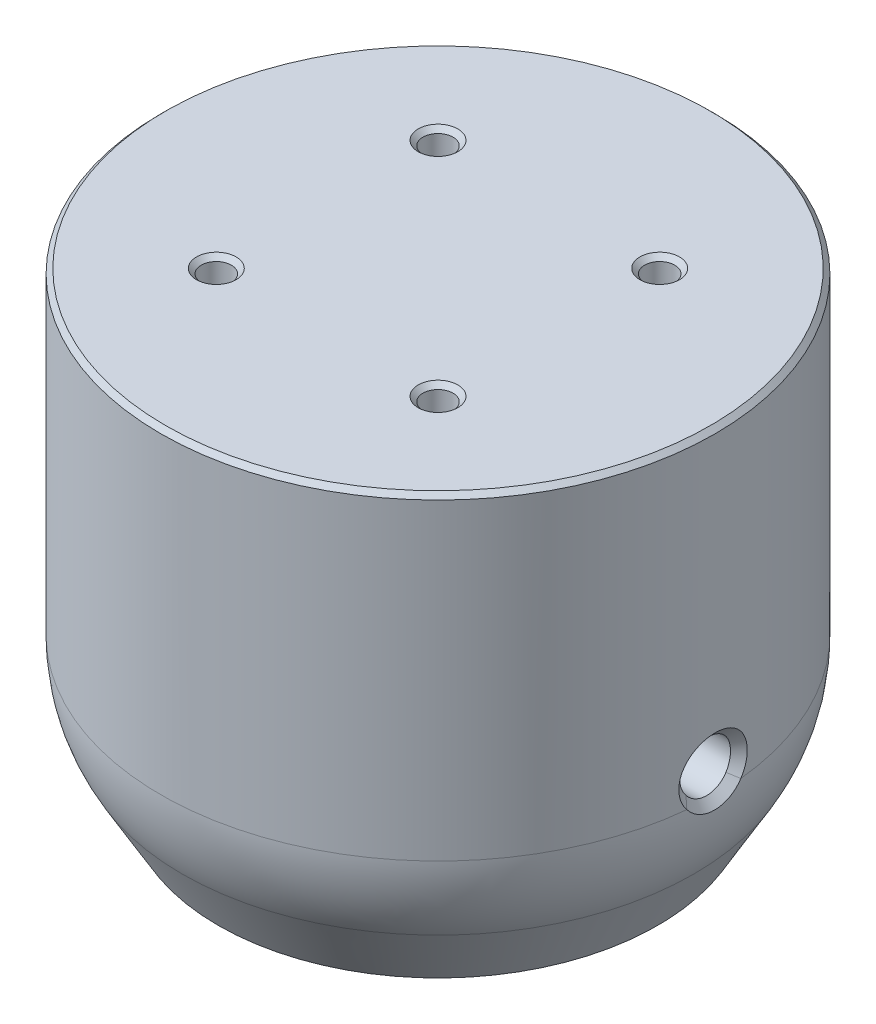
ISO-10303-21;
HEADER;
FILE_DESCRIPTION(('STEP AP214'),'2;1');
FILE_NAME('part.step','',(''),(''),'','','');
FILE_SCHEMA(('AUTOMOTIVE_DESIGN { 1 0 10303 214 1 1 1 1 }'));
ENDSEC;
DATA;
#1=APPLICATION_CONTEXT('core data for automotive mechanical design processes');
#2=APPLICATION_PROTOCOL_DEFINITION('international standard','automotive_design',2000,#1);
#3=PRODUCT_CONTEXT('',#1,'mechanical');
#4=PRODUCT('Part','Part','',(#3));
#5=PRODUCT_RELATED_PRODUCT_CATEGORY('part','',(#4));
#6=PRODUCT_DEFINITION_FORMATION('','',#4);
#7=PRODUCT_DEFINITION_CONTEXT('part definition',#1,'design');
#8=PRODUCT_DEFINITION('design','',#6,#7);
#9=PRODUCT_DEFINITION_SHAPE('','',#8);
#10=(LENGTH_UNIT() NAMED_UNIT(*) SI_UNIT(.MILLI.,.METRE.));
#11=(NAMED_UNIT(*) PLANE_ANGLE_UNIT() SI_UNIT($,.RADIAN.));
#12=(NAMED_UNIT(*) SI_UNIT($,.STERADIAN.) SOLID_ANGLE_UNIT());
#13=UNCERTAINTY_MEASURE_WITH_UNIT(LENGTH_MEASURE(1.E-05),#10,'distance_accuracy_value','');
#14=(GEOMETRIC_REPRESENTATION_CONTEXT(3) GLOBAL_UNCERTAINTY_ASSIGNED_CONTEXT((#13)) GLOBAL_UNIT_ASSIGNED_CONTEXT((#10,
#11,#12)) REPRESENTATION_CONTEXT('',''));
#15=CARTESIAN_POINT('',(0.,0.,0.));
#16=DIRECTION('',(0.,0.,1.));
#17=DIRECTION('',(1.,0.,0.));
#18=AXIS2_PLACEMENT_3D('',#15,#16,#17);
#19=CARTESIAN_POINT('',(0.,0.,0.));
#20=DIRECTION('',(0.,-1.,0.));
#21=DIRECTION('',(0.,0.,-1.));
#22=AXIS2_PLACEMENT_3D('',#19,#20,#21);
#23=CYLINDRICAL_SURFACE('',#22,25.75);
#24=CARTESIAN_POINT('',(25.5503913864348,-37.5,3.19999999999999));
#25=CARTESIAN_POINT('',(25.5503939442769,-37.3210007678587,3.19999238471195));
#26=CARTESIAN_POINT('',(25.5522927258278,-37.141889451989,3.18493023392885));
#27=CARTESIAN_POINT('',(25.55967988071,-36.7886509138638,3.12508214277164));
#28=CARTESIAN_POINT('',(25.5651720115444,-36.6145291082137,3.08026508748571));
#29=CARTESIAN_POINT('',(25.5791143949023,-36.2764350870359,2.96224829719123));
#30=CARTESIAN_POINT('',(25.5875626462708,-36.112456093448,2.88906775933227));
#31=CARTESIAN_POINT('',(25.606462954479,-35.7991370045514,2.71644228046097));
#32=CARTESIAN_POINT('',(25.6169146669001,-35.6497943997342,2.61700185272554));
#33=CARTESIAN_POINT('',(25.6387090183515,-35.3691303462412,2.39408990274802));
#34=CARTESIAN_POINT('',(25.6500558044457,-35.2379015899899,2.27050206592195));
#35=CARTESIAN_POINT('',(25.6723244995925,-34.997990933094,2.003053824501));
#36=CARTESIAN_POINT('',(25.6832463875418,-34.8893101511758,1.85919241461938));
#37=CARTESIAN_POINT('',(25.7034770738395,-34.6972483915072,1.55469860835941));
#38=CARTESIAN_POINT('',(25.7127804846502,-34.6139512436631,1.39401294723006));
#39=CARTESIAN_POINT('',(25.7286804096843,-34.4755581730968,1.06079887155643));
#40=CARTESIAN_POINT('',(25.7352770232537,-34.4204612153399,0.88827089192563));
#41=CARTESIAN_POINT('',(25.744990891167,-34.3403093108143,0.537217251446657));
#42=CARTESIAN_POINT('',(25.7481259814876,-34.3151003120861,0.358727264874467));
#43=CARTESIAN_POINT('',(25.7506244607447,-34.294962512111,2.45845654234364E-05));
#44=CARTESIAN_POINT('',(25.7499879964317,-34.3000325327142,-0.180188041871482));
#45=CARTESIAN_POINT('',(25.7450295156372,-34.3401853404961,-0.536172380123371));
#46=CARTESIAN_POINT('',(25.7407278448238,-34.3751024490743,-0.711963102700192));
#47=CARTESIAN_POINT('',(25.7289451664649,-34.4736993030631,-1.0551702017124));
#48=CARTESIAN_POINT('',(25.7214640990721,-34.5373795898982,-1.22258642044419));
#49=CARTESIAN_POINT('',(25.7041281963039,-34.6918715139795,-1.5448053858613));
#50=CARTESIAN_POINT('',(25.6942670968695,-34.7827549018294,-1.69957338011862));
#51=CARTESIAN_POINT('',(25.6732744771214,-34.9890209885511,-1.99172350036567));
#52=CARTESIAN_POINT('',(25.6621428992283,-35.1044047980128,-2.12910483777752));
#53=CARTESIAN_POINT('',(25.6397664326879,-35.3573244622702,-2.38355514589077));
#54=CARTESIAN_POINT('',(25.6285212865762,-35.4950046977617,-2.50048062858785));
#55=CARTESIAN_POINT('',(25.6072593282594,-35.7881128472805,-2.70958509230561));
#56=CARTESIAN_POINT('',(25.5972425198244,-35.9435408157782,-2.80176399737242));
#57=CARTESIAN_POINT('',(25.5795714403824,-36.267859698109,-2.95876661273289));
#58=CARTESIAN_POINT('',(25.5719181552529,-36.4367561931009,-3.02357891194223));
#59=CARTESIAN_POINT('',(25.5598599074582,-36.7831517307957,-3.12388171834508));
#60=CARTESIAN_POINT('',(25.5554547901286,-36.9606503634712,-3.1593736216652));
#61=CARTESIAN_POINT('',(25.5504198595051,-37.3179446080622,-3.19983829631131));
#62=CARTESIAN_POINT('',(25.5497650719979,-37.4977170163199,-3.20501296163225));
#63=CARTESIAN_POINT('',(25.5522388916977,-37.8555662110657,-3.18522889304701));
#64=CARTESIAN_POINT('',(25.5553674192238,-38.0336430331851,-3.16027079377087));
#65=CARTESIAN_POINT('',(25.565032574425,-38.3824416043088,-3.08109961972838));
#66=CARTESIAN_POINT('',(25.5715578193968,-38.5531858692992,-3.02698423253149));
#67=CARTESIAN_POINT('',(25.5872719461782,-38.8831767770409,-2.89113515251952));
#68=CARTESIAN_POINT('',(25.5964609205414,-39.0424230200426,-2.80940050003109));
#69=CARTESIAN_POINT('',(25.6165269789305,-39.3458111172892,-2.62013634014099));
#70=CARTESIAN_POINT('',(25.6274126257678,-39.4898697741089,-2.51247439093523));
#71=CARTESIAN_POINT('',(25.6496185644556,-39.757944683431,-2.2745990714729));
#72=CARTESIAN_POINT('',(25.6609388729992,-39.8819601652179,-2.14438483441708));
#73=CARTESIAN_POINT('',(25.6828152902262,-40.1071371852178,-1.86421948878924));
#74=CARTESIAN_POINT('',(25.6933667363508,-40.2081660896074,-1.71416136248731));
#75=CARTESIAN_POINT('',(25.7124468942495,-40.3835845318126,-1.39908854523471));
#76=CARTESIAN_POINT('',(25.7209756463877,-40.4579746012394,-1.23407415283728));
#77=CARTESIAN_POINT('',(25.7350287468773,-40.5777845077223,-0.894214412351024));
#78=CARTESIAN_POINT('',(25.740561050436,-40.6232811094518,-0.719396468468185));
#79=CARTESIAN_POINT('',(25.7480309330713,-40.6842623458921,-0.364529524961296));
#80=CARTESIAN_POINT('',(25.7499686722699,-40.6997483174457,-0.184480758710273));
#81=CARTESIAN_POINT('',(25.7500303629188,-40.7002439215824,0.17444158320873));
#82=CARTESIAN_POINT('',(25.7481799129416,-40.6854581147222,0.353314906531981));
#83=CARTESIAN_POINT('',(25.7409240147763,-40.6262629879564,0.706013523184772));
#84=CARTESIAN_POINT('',(25.7355185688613,-40.5818536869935,0.879838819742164));
#85=CARTESIAN_POINT('',(25.7217573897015,-40.4647361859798,1.21748111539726));
#86=CARTESIAN_POINT('',(25.7134026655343,-40.3920376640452,1.38130151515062));
#87=CARTESIAN_POINT('',(25.6946682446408,-40.2204265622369,1.69444966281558));
#88=CARTESIAN_POINT('',(25.6842885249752,-40.1215136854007,1.84377724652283));
#89=CARTESIAN_POINT('',(25.6625791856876,-39.899524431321,2.12474610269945));
#90=CARTESIAN_POINT('',(25.6512438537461,-39.7762958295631,2.25626667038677));
#91=CARTESIAN_POINT('',(25.6289467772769,-39.5094889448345,2.4968427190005));
#92=CARTESIAN_POINT('',(25.6179851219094,-39.3659058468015,2.60589286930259));
#93=CARTESIAN_POINT('',(25.5976318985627,-39.0618378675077,2.79878784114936));
#94=CARTESIAN_POINT('',(25.5882464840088,-38.9012905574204,2.88253485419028));
#95=CARTESIAN_POINT('',(25.5721805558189,-38.5683845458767,3.02176061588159));
#96=CARTESIAN_POINT('',(25.565497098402,-38.3960389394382,3.07727014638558));
#97=CARTESIAN_POINT('',(25.5572166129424,-38.1023321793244,3.14513798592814));
#98=CARTESIAN_POINT('',(25.5546698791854,-37.9828244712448,3.1656817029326));
#99=CARTESIAN_POINT('',(25.5512564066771,-37.7422282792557,3.19311523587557));
#100=CARTESIAN_POINT('',(25.5503896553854,-37.6211398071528,3.20000515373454));
#101=CARTESIAN_POINT('',(25.5503913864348,-37.5,3.19999999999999));
#102=B_SPLINE_CURVE_WITH_KNOTS('',3,(#24,#25,#26,#27,#28,#29,#30,#31,#32,#33,#34,#35,#36,#37,
#38,#39,#40,#41,#42,#43,#44,#45,#46,#47,#48,#49,#50,#51,#52,#53,#54,#55,#56,#57,#58,#59,#60,#61,
#62,#63,#64,#65,#66,#67,#68,#69,#70,#71,#72,#73,#74,#75,#76,#77,#78,#79,#80,#81,#82,#83,#84,#85,
#86,#87,#88,#89,#90,#91,#92,#93,#94,#95,#96,#97,#98,#99,#100,#101),.UNSPECIFIED.,.T.,.F.,(4,2,2,
2,2,2,2,2,2,2,2,2,2,2,2,2,2,2,2,2,2,2,2,2,2,2,2,2,2,2,2,2,2,2,2,2,2,2,4),(0.,0.536555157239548,
1.07367227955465,1.6104264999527,2.14708852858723,2.68640231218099,3.22574284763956,
3.76684572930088,4.30792874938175,4.84621056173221,5.38447142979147,5.91976371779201,
6.45506608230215,6.99179298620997,7.52854422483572,8.06892144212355,8.60930031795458,
9.14990429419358,9.69048252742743,10.2274567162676,10.7644195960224,11.2995945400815,
11.8347880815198,12.372775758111,12.9107841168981,13.4518222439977,13.9928495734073,
14.5324334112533,15.0719932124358,15.607918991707,16.1438444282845,16.6795866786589,
17.2153349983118,17.7545502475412,18.2938932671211,18.8352951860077,19.3761056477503,
19.7392282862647,20.1023482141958),.UNSPECIFIED.);
#103=CARTESIAN_POINT('',(25.5503913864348,-37.5,3.19999999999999));
#104=VERTEX_POINT('',#103);
#105=EDGE_CURVE('E103',#104,#104,#102,.T.);
#106=ORIENTED_EDGE('',*,*,#105,.F.);
#107=EDGE_LOOP('',(#106));
#108=FACE_BOUND('',#107,.T.);
#109=CARTESIAN_POINT('',(0.,-58.,0.));
#110=DIRECTION('',(0.,-1.,0.));
#111=DIRECTION('',(0.,0.,-1.));
#112=AXIS2_PLACEMENT_3D('',#109,#110,#111);
#113=CIRCLE('',#112,25.75);
#114=CARTESIAN_POINT('',(0.,-58.,-25.75));
#115=VERTEX_POINT('',#114);
#116=EDGE_CURVE('E163',#115,#115,#113,.T.);
#117=ORIENTED_EDGE('',*,*,#116,.T.);
#118=EDGE_LOOP('',(#117));
#119=FACE_BOUND('',#118,.T.);
#120=DIRECTION('',(0.,1.,0.));
#121=VECTOR('',#120,1.);
#122=CARTESIAN_POINT('',(-25.25,-28.,5.04975246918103));
#123=LINE('',#122,#121);
#124=CARTESIAN_POINT('',(-25.25,-28.,5.04975246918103));
#125=VERTEX_POINT('',#124);
#126=CARTESIAN_POINT('',(-25.25,-9.99999999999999,5.04975246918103));
#127=VERTEX_POINT('',#126);
#128=EDGE_CURVE('E92',#125,#127,#123,.T.);
#129=ORIENTED_EDGE('',*,*,#128,.T.);
#130=CARTESIAN_POINT('',(0.,-9.99999999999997,0.));
#131=DIRECTION('',(0.,-1.,0.));
#132=DIRECTION('',(0.,0.,-1.));
#133=AXIS2_PLACEMENT_3D('',#130,#131,#132);
#134=CIRCLE('',#133,25.75);
#135=CARTESIAN_POINT('',(-25.25,-9.99999999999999,-5.04975246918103));
#136=VERTEX_POINT('',#135);
#137=EDGE_CURVE('E56',#127,#136,#134,.F.);
#138=ORIENTED_EDGE('',*,*,#137,.T.);
#139=DIRECTION('',(0.,1.,0.));
#140=VECTOR('',#139,1.);
#141=CARTESIAN_POINT('',(-25.25,-28.,-5.04975246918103));
#142=LINE('',#141,#140);
#143=CARTESIAN_POINT('',(-25.25,-28.,-5.04975246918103));
#144=VERTEX_POINT('',#143);
#145=EDGE_CURVE('E91',#144,#136,#142,.T.);
#146=ORIENTED_EDGE('',*,*,#145,.F.);
#147=CARTESIAN_POINT('',(0.,-28.,0.));
#148=DIRECTION('',(0.,-1.,0.));
#149=DIRECTION('',(0.,0.,-1.));
#150=AXIS2_PLACEMENT_3D('',#147,#148,#149);
#151=CIRCLE('',#150,25.75);
#152=EDGE_CURVE('E95',#125,#144,#151,.T.);
#153=ORIENTED_EDGE('',*,*,#152,.F.);
#154=EDGE_LOOP('',(#129,#138,#146,#153));
#155=FACE_BOUND('',#154,.T.);
#156=ADVANCED_FACE('F41',(#108,#119,#155),#23,.F.);
#157=CARTESIAN_POINT('',(25.75,-8.,0.));
#158=DIRECTION('',(0.,-1.,0.));
#159=DIRECTION('',(0.,0.,-1.));
#160=AXIS2_PLACEMENT_3D('',#157,#158,#159);
#161=PLANE('',#160);
#162=CARTESIAN_POINT('',(0.,-8.,0.));
#163=DIRECTION('',(0.,-1.,0.));
#164=DIRECTION('',(0.,0.,-1.));
#165=AXIS2_PLACEMENT_3D('',#162,#163,#164);
#166=CIRCLE('',#165,25.0220595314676);
#167=CARTESIAN_POINT('',(-24.5361942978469,-8.,-4.906998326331));
#168=VERTEX_POINT('',#167);
#169=EDGE_CURVE('E61',#168,#168,#166,.T.);
#170=ORIENTED_EDGE('',*,*,#169,.T.);
#171=EDGE_LOOP('',(#170));
#172=FACE_BOUND('',#171,.T.);
#173=CARTESIAN_POINT('',(-14.,-8.,-14.));
#174=DIRECTION('',(0.,-1.,0.));
#175=DIRECTION('',(0.,0.,-1.));
#176=AXIS2_PLACEMENT_3D('',#173,#174,#175);
#177=CIRCLE('',#176,3.25);
#178=CARTESIAN_POINT('',(-14.,-8.,-17.25));
#179=VERTEX_POINT('',#178);
#180=EDGE_CURVE('E106',#179,#179,#177,.T.);
#181=ORIENTED_EDGE('',*,*,#180,.F.);
#182=EDGE_LOOP('',(#181));
#183=FACE_BOUND('',#182,.T.);
#184=CARTESIAN_POINT('',(14.,-8.,14.));
#185=DIRECTION('',(0.,-1.,0.));
#186=DIRECTION('',(0.,0.,-1.));
#187=AXIS2_PLACEMENT_3D('',#184,#185,#186);
#188=CIRCLE('',#187,3.25);
#189=CARTESIAN_POINT('',(14.,-8.,10.75));
#190=VERTEX_POINT('',#189);
#191=EDGE_CURVE('E317',#190,#190,#188,.T.);
#192=ORIENTED_EDGE('',*,*,#191,.F.);
#193=EDGE_LOOP('',(#192));
#194=FACE_BOUND('',#193,.T.);
#195=CARTESIAN_POINT('',(14.,-8.,-14.));
#196=DIRECTION('',(0.,-1.,0.));
#197=DIRECTION('',(0.,0.,-1.));
#198=AXIS2_PLACEMENT_3D('',#195,#196,#197);
#199=CIRCLE('',#198,3.25);
#200=CARTESIAN_POINT('',(14.,-8.,-17.25));
#201=VERTEX_POINT('',#200);
#202=EDGE_CURVE('E321',#201,#201,#199,.T.);
#203=ORIENTED_EDGE('',*,*,#202,.F.);
#204=EDGE_LOOP('',(#203));
#205=FACE_BOUND('',#204,.T.);
#206=CARTESIAN_POINT('',(-14.,-8.,14.));
#207=DIRECTION('',(0.,-1.,0.));
#208=DIRECTION('',(0.,0.,-1.));
#209=AXIS2_PLACEMENT_3D('',#206,#207,#208);
#210=CIRCLE('',#209,3.25);
#211=CARTESIAN_POINT('',(-14.,-8.,10.75));
#212=VERTEX_POINT('',#211);
#213=EDGE_CURVE('E324',#212,#212,#210,.T.);
#214=ORIENTED_EDGE('',*,*,#213,.F.);
#215=EDGE_LOOP('',(#214));
#216=FACE_BOUND('',#215,.T.);
#217=ADVANCED_FACE('F195',(#172,#183,#194,#205,#216),#161,.T.);
#218=CARTESIAN_POINT('',(0.,-40.0836477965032,0.));
#219=DIRECTION('',(0.,-1.,0.));
#220=DIRECTION('',(0.,0.,-1.));
#221=AXIS2_PLACEMENT_3D('',#218,#219,#220);
#222=DEGENERATE_TOROIDAL_SURFACE('',#221,15.,20.,.T.);
#223=CARTESIAN_POINT('',(0.,-40.0836477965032,0.));
#224=DIRECTION('',(0.,-1.,0.));
#225=DIRECTION('',(0.,0.,-1.));
#226=AXIS2_PLACEMENT_3D('',#223,#224,#225);
#227=CIRCLE('',#226,35.);
#228=CARTESIAN_POINT('',(34.8336154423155,-40.0836477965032,3.40869993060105));
#229=VERTEX_POINT('',#228);
#230=CARTESIAN_POINT('',(34.8336154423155,-40.0836477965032,-3.40869993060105));
#231=VERTEX_POINT('',#230);
#232=EDGE_CURVE('E168',#229,#231,#227,.T.);
#233=ORIENTED_EDGE('',*,*,#232,.T.);
#234=CARTESIAN_POINT('',(34.8336154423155,-40.0836477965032,3.40869993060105));
#235=CARTESIAN_POINT('',(34.8385774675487,-40.1501022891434,3.35799208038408));
#236=CARTESIAN_POINT('',(34.8432685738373,-40.2149610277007,3.30551454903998));
#237=CARTESIAN_POINT('',(34.8521527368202,-40.341501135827,3.19703933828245));
#238=CARTESIAN_POINT('',(34.8563447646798,-40.4031679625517,3.14105429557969));
#239=CARTESIAN_POINT('',(34.8642745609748,-40.5233689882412,3.0255021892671));
#240=CARTESIAN_POINT('',(34.868007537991,-40.5818435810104,2.96596565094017));
#241=CARTESIAN_POINT('',(34.8749891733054,-40.6945161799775,2.84451552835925));
#242=CARTESIAN_POINT('',(34.8782526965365,-40.7489386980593,2.78238909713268));
#243=CARTESIAN_POINT('',(34.8874131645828,-40.9062575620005,2.59216849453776));
#244=CARTESIAN_POINT('',(34.8926970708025,-41.0034524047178,2.460022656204));
#245=CARTESIAN_POINT('',(34.899615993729,-41.1376610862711,2.25395279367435));
#246=CARTESIAN_POINT('',(34.9017541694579,-41.1804685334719,2.18394577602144));
#247=CARTESIAN_POINT('',(34.9057261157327,-41.2621775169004,2.0412661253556));
#248=CARTESIAN_POINT('',(34.9075588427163,-41.3010572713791,1.96863488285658));
#249=CARTESIAN_POINT('',(34.9109514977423,-41.3749131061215,1.82048468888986));
#250=CARTESIAN_POINT('',(34.912504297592,-41.4097399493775,1.7452124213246));
#251=CARTESIAN_POINT('',(34.9153245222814,-41.4745053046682,1.59391093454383));
#252=CARTESIAN_POINT('',(34.9165995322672,-41.5046094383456,1.51755304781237));
#253=CARTESIAN_POINT('',(34.9200578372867,-41.5879949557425,1.28680523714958));
#254=CARTESIAN_POINT('',(34.9218836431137,-41.6345179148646,1.13044695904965));
#255=CARTESIAN_POINT('',(34.9240332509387,-41.6906938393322,0.892265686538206));
#256=CARTESIAN_POINT('',(34.9246510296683,-41.707149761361,0.812256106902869));
#257=CARTESIAN_POINT('',(34.9257024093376,-41.7354651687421,0.650989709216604));
#258=CARTESIAN_POINT('',(34.926135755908,-41.7473173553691,0.569791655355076));
#259=CARTESIAN_POINT('',(34.9268270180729,-41.7663535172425,0.405885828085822));
#260=CARTESIAN_POINT('',(34.9270823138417,-41.7734644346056,0.323647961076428));
#261=CARTESIAN_POINT('',(34.9274181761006,-41.7828400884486,0.159910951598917));
#262=CARTESIAN_POINT('',(34.9274998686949,-41.7851368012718,0.0781416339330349));
#263=CARTESIAN_POINT('',(34.9274927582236,-41.784935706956,-0.166574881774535));
#264=CARTESIAN_POINT('',(34.9271554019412,-41.7753905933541,-0.32914059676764));
#265=CARTESIAN_POINT('',(34.9261238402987,-41.7469923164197,-0.572041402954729));
#266=CARTESIAN_POINT('',(34.9256917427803,-41.7351749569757,-0.652854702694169));
#267=CARTESIAN_POINT('',(34.9246370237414,-41.7067755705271,-0.814170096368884));
#268=CARTESIAN_POINT('',(34.9240149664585,-41.6902072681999,-0.894614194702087));
#269=CARTESIAN_POINT('',(34.9225577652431,-41.6521439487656,-1.05541626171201));
#270=CARTESIAN_POINT('',(34.9217276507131,-41.6307847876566,-1.13514584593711));
#271=CARTESIAN_POINT('',(34.9198565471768,-41.5837176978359,-1.29248904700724));
#272=CARTESIAN_POINT('',(34.9188140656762,-41.5579708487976,-1.37026689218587));
#273=CARTESIAN_POINT('',(34.9153365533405,-41.4742308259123,-1.60081217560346));
#274=CARTESIAN_POINT('',(34.9125533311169,-41.4097322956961,-1.75089915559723));
#275=CARTESIAN_POINT('',(34.9058287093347,-41.263446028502,-2.04381622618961));
#276=CARTESIAN_POINT('',(34.9018907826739,-41.181710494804,-2.18657586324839));
#277=CARTESIAN_POINT('',(34.8925204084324,-41.0001028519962,-2.46490141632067));
#278=CARTESIAN_POINT('',(34.8871731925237,-40.9019543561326,-2.59778074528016));
#279=CARTESIAN_POINT('',(34.8749225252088,-40.6919372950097,-2.85088485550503));
#280=CARTESIAN_POINT('',(34.8680161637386,-40.5799985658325,-2.97121124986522));
#281=CARTESIAN_POINT('',(34.8523240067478,-40.342308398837,-3.19940902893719));
#282=CARTESIAN_POINT('',(34.8435386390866,-40.2165520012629,-3.30728029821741));
#283=CARTESIAN_POINT('',(34.8336154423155,-40.0836477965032,-3.40869993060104));
#284=B_SPLINE_CURVE_WITH_KNOTS('',3,(#234,#235,#236,#237,#238,#239,#240,#241,#242,#243,#244,
#245,#246,#247,#248,#249,#250,#251,#252,#253,#254,#255,#256,#257,#258,#259,#260,#261,#262,#263,
#264,#265,#266,#267,#268,#269,#270,#271,#272,#273,#274,#275,#276,#277,#278,#279,#280,#281,#282,
#283),.UNSPECIFIED.,.F.,.F.,(4,2,2,2,2,2,2,2,2,2,2,2,2,2,2,2,2,2,2,2,2,2,2,2,4),(0.,
0.000237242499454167,0.000474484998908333,0.0007117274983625,0.000948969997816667,
0.001423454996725,0.00166069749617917,0.00189793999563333,0.0021351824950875,
0.00237242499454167,0.00284690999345,0.00308415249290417,0.00332139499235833,0.0035586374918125,
0.00379587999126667,0.004270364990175,0.00450760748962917,0.00474484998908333,
0.0049820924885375,0.00521933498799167,0.0056938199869,0.00616830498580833,0.00664278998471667,
0.007117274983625,0.00759175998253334),.UNSPECIFIED.);
#285=EDGE_CURVE('E154',#231,#229,#284,.F.);
#286=ORIENTED_EDGE('',*,*,#285,.T.);
#287=EDGE_LOOP('',(#233,#286));
#288=FACE_BOUND('',#287,.T.);
#289=CARTESIAN_POINT('',(0.,-50.0836477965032,0.));
#290=DIRECTION('',(0.,-1.,0.));
#291=DIRECTION('',(0.,0.,-1.));
#292=AXIS2_PLACEMENT_3D('',#289,#290,#291);
#293=CIRCLE('',#292,32.3205080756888);
#294=CARTESIAN_POINT('',(0.,-50.0836477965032,-32.3205080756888));
#295=VERTEX_POINT('',#294);
#296=EDGE_CURVE('E157',#295,#295,#293,.T.);
#297=ORIENTED_EDGE('',*,*,#296,.F.);
#298=EDGE_LOOP('',(#297));
#299=FACE_BOUND('',#298,.T.);
#300=ADVANCED_FACE('F184',(#288,#299),#222,.T.);
#301=CARTESIAN_POINT('',(0.,-58.,0.));
#302=DIRECTION('',(0.,1.,0.));
#303=DIRECTION('',(0.,0.,1.));
#304=AXIS2_PLACEMENT_3D('',#301,#302,#303);
#305=CONICAL_SURFACE('',#304,27.75,0.523598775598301);
#306=ORIENTED_EDGE('',*,*,#296,.T.);
#307=EDGE_LOOP('',(#306));
#308=FACE_BOUND('',#307,.T.);
#309=CARTESIAN_POINT('',(0.,-58.,0.));
#310=DIRECTION('',(0.,-1.,0.));
#311=DIRECTION('',(0.,0.,-1.));
#312=AXIS2_PLACEMENT_3D('',#309,#310,#311);
#313=CIRCLE('',#312,27.75);
#314=CARTESIAN_POINT('',(0.,-58.,-27.75));
#315=VERTEX_POINT('',#314);
#316=EDGE_CURVE('E159',#315,#315,#313,.T.);
#317=ORIENTED_EDGE('',*,*,#316,.F.);
#318=EDGE_LOOP('',(#317));
#319=FACE_BOUND('',#318,.T.);
#320=ADVANCED_FACE('F194',(#308,#319),#305,.T.);
#321=CARTESIAN_POINT('',(27.75,-58.,0.));
#322=DIRECTION('',(0.,-1.,0.));
#323=DIRECTION('',(0.,0.,-1.));
#324=AXIS2_PLACEMENT_3D('',#321,#322,#323);
#325=PLANE('',#324);
#326=ORIENTED_EDGE('',*,*,#316,.T.);
#327=EDGE_LOOP('',(#326));
#328=FACE_BOUND('',#327,.T.);
#329=ORIENTED_EDGE('',*,*,#116,.F.);
#330=EDGE_LOOP('',(#329));
#331=FACE_BOUND('',#330,.T.);
#332=ADVANCED_FACE('F369',(#328,#331),#325,.T.);
#333=CARTESIAN_POINT('',(0.,0.,0.));
#334=DIRECTION('',(0.,1.,0.));
#335=DIRECTION('',(0.,0.,1.));
#336=AXIS2_PLACEMENT_3D('',#333,#334,#335);
#337=PLANE('',#336);
#338=CARTESIAN_POINT('',(0.,0.,0.));
#339=DIRECTION('',(0.,1.,0.));
#340=DIRECTION('',(0.,0.,1.));
#341=AXIS2_PLACEMENT_3D('',#338,#339,#340);
#342=CIRCLE('',#341,34.4);
#343=CARTESIAN_POINT('',(0.,0.,34.4));
#344=VERTEX_POINT('',#343);
#345=EDGE_CURVE('E293',#344,#344,#342,.T.);
#346=ORIENTED_EDGE('',*,*,#345,.T.);
#347=EDGE_LOOP('',(#346));
#348=FACE_BOUND('',#347,.T.);
#349=CARTESIAN_POINT('',(-14.,0.,14.));
#350=DIRECTION('',(0.,1.,0.));
#351=DIRECTION('',(0.,0.,1.));
#352=AXIS2_PLACEMENT_3D('',#349,#350,#351);
#353=CIRCLE('',#352,2.49999999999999);
#354=CARTESIAN_POINT('',(-14.,0.,16.5));
#355=VERTEX_POINT('',#354);
#356=EDGE_CURVE('E290',#355,#355,#353,.F.);
#357=ORIENTED_EDGE('',*,*,#356,.T.);
#358=EDGE_LOOP('',(#357));
#359=FACE_BOUND('',#358,.T.);
#360=CARTESIAN_POINT('',(14.,0.,-14.));
#361=DIRECTION('',(0.,1.,0.));
#362=DIRECTION('',(0.,0.,1.));
#363=AXIS2_PLACEMENT_3D('',#360,#361,#362);
#364=CIRCLE('',#363,2.49999999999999);
#365=CARTESIAN_POINT('',(14.,0.,-11.5));
#366=VERTEX_POINT('',#365);
#367=EDGE_CURVE('E287',#366,#366,#364,.F.);
#368=ORIENTED_EDGE('',*,*,#367,.T.);
#369=EDGE_LOOP('',(#368));
#370=FACE_BOUND('',#369,.T.);
#371=CARTESIAN_POINT('',(14.,0.,14.));
#372=DIRECTION('',(0.,1.,0.));
#373=DIRECTION('',(0.,0.,1.));
#374=AXIS2_PLACEMENT_3D('',#371,#372,#373);
#375=CIRCLE('',#374,2.49999999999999);
#376=CARTESIAN_POINT('',(14.,0.,16.5));
#377=VERTEX_POINT('',#376);
#378=EDGE_CURVE('E284',#377,#377,#375,.F.);
#379=ORIENTED_EDGE('',*,*,#378,.T.);
#380=EDGE_LOOP('',(#379));
#381=FACE_BOUND('',#380,.T.);
#382=CARTESIAN_POINT('',(-14.,0.,-14.));
#383=DIRECTION('',(0.,1.,0.));
#384=DIRECTION('',(0.,0.,1.));
#385=AXIS2_PLACEMENT_3D('',#382,#383,#384);
#386=CIRCLE('',#385,2.49999999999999);
#387=CARTESIAN_POINT('',(-14.,0.,-11.5));
#388=VERTEX_POINT('',#387);
#389=EDGE_CURVE('E281',#388,#388,#386,.F.);
#390=ORIENTED_EDGE('',*,*,#389,.T.);
#391=EDGE_LOOP('',(#390));
#392=FACE_BOUND('',#391,.T.);
#393=ADVANCED_FACE('F371',(#348,#359,#370,#381,#392),#337,.T.);
#394=CARTESIAN_POINT('',(0.,0.,0.));
#395=DIRECTION('',(0.,-1.,0.));
#396=DIRECTION('',(0.,0.,-1.));
#397=AXIS2_PLACEMENT_3D('',#394,#395,#396);
#398=CYLINDRICAL_SURFACE('',#397,35.);
#399=CARTESIAN_POINT('',(0.,-0.600000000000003,0.));
#400=DIRECTION('',(0.,1.,0.));
#401=DIRECTION('',(0.,0.,1.));
#402=AXIS2_PLACEMENT_3D('',#399,#400,#401);
#403=CIRCLE('',#402,35.);
#404=CARTESIAN_POINT('',(0.,-0.600000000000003,35.));
#405=VERTEX_POINT('',#404);
#406=EDGE_CURVE('E273',#405,#405,#403,.F.);
#407=ORIENTED_EDGE('',*,*,#406,.T.);
#408=EDGE_LOOP('',(#407));
#409=FACE_BOUND('',#408,.T.);
#410=ORIENTED_EDGE('',*,*,#232,.F.);
#411=CARTESIAN_POINT('',(34.8336154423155,-40.0836477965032,-3.40869993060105));
#412=CARTESIAN_POINT('',(34.8275093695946,-40.0059601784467,-3.47109727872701));
#413=CARTESIAN_POINT('',(34.8215192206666,-39.9262642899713,-3.53058496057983));
#414=CARTESIAN_POINT('',(34.8127743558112,-39.8037263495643,-3.61546026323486));
#415=CARTESIAN_POINT('',(34.8098963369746,-39.7623300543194,-3.64305406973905));
#416=CARTESIAN_POINT('',(34.804249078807,-39.6787953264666,-3.69661608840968));
#417=CARTESIAN_POINT('',(34.8014824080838,-39.6367024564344,-3.72256226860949));
#418=CARTESIAN_POINT('',(34.7879498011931,-39.4244847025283,-3.84821189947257));
#419=CARTESIAN_POINT('',(34.7780898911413,-39.2493479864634,-3.93575013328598));
#420=CARTESIAN_POINT('',(34.7651484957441,-38.9786973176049,-4.04794628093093));
#421=CARTESIAN_POINT('',(34.7611422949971,-38.8871544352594,-4.08215126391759));
#422=CARTESIAN_POINT('',(34.7538117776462,-38.7013820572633,-4.14409698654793));
#423=CARTESIAN_POINT('',(34.7504897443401,-38.6072266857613,-4.1718185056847));
#424=CARTESIAN_POINT('',(34.746061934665,-38.4637017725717,-4.20848323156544));
#425=CARTESIAN_POINT('',(34.7446829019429,-38.4155935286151,-4.21984846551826));
#426=CARTESIAN_POINT('',(34.7421388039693,-38.3194379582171,-4.2407430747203));
#427=CARTESIAN_POINT('',(34.7409698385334,-38.2712660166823,-4.25030479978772));
#428=CARTESIAN_POINT('',(34.7377808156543,-38.1266699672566,-4.27631727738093));
#429=CARTESIAN_POINT('',(34.7360740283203,-38.0300171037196,-4.29013629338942));
#430=CARTESIAN_POINT('',(34.7335140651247,-37.8362967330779,-4.3108130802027));
#431=CARTESIAN_POINT('',(34.7326604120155,-37.7392142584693,-4.31767441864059));
#432=CARTESIAN_POINT('',(34.7318178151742,-37.5446048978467,-4.32444711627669));
#433=CARTESIAN_POINT('',(34.731828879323,-37.4470762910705,-4.32435847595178));
#434=CARTESIAN_POINT('',(34.7327275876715,-37.2515753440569,-4.31713415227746));
#435=CARTESIAN_POINT('',(34.7336159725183,-37.1535471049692,-4.30999282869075));
#436=CARTESIAN_POINT('',(34.7362787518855,-36.9572380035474,-4.28847953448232));
#437=CARTESIAN_POINT('',(34.7380362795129,-36.8601263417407,-4.2742427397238));
#438=CARTESIAN_POINT('',(34.7423572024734,-36.6676851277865,-4.23897766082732));
#439=CARTESIAN_POINT('',(34.7449200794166,-36.5723971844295,-4.21795346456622));
#440=CARTESIAN_POINT('',(34.7508023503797,-36.3836602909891,-4.16921315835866));
#441=CARTESIAN_POINT('',(34.7541218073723,-36.2902113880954,-4.14149688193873));
#442=CARTESIAN_POINT('',(34.7614694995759,-36.1051531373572,-4.07936470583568));
#443=CARTESIAN_POINT('',(34.7654990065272,-36.0135222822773,-4.04493823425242));
#444=CARTESIAN_POINT('',(34.7720349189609,-35.8775404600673,-3.9882265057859));
#445=CARTESIAN_POINT('',(34.7742981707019,-35.8324102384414,-3.96845259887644));
#446=CARTESIAN_POINT('',(34.7789788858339,-35.7427046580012,-3.92722031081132));
#447=CARTESIAN_POINT('',(34.7814038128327,-35.6979987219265,-3.90569474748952));
#448=CARTESIAN_POINT('',(34.7888632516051,-35.5653794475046,-3.83888024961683));
#449=CARTESIAN_POINT('',(34.794072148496,-35.4790830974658,-3.7914516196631));
#450=CARTESIAN_POINT('',(34.8048921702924,-35.3103079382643,-3.6908051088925));
#451=CARTESIAN_POINT('',(34.8105003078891,-35.2278807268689,-3.63761474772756));
#452=CARTESIAN_POINT('',(34.822027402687,-35.0668997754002,-3.52556084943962));
#453=CARTESIAN_POINT('',(34.8279464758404,-34.9883460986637,-3.46669723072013));
#454=CARTESIAN_POINT('',(34.8400109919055,-34.8351222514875,-3.34327356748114));
#455=CARTESIAN_POINT('',(34.8461593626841,-34.7604216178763,-3.2786808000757));
#456=CARTESIAN_POINT('',(34.8554789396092,-34.651424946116,-3.17753706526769));
#457=CARTESIAN_POINT('',(34.8586049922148,-34.6155666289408,-3.14307258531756));
#458=CARTESIAN_POINT('',(34.864881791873,-34.5448437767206,-3.07266475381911));
#459=CARTESIAN_POINT('',(34.8680289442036,-34.510022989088,-3.03675763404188));
#460=CARTESIAN_POINT('',(34.8774166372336,-34.4078715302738,-2.92764841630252));
#461=CARTESIAN_POINT('',(34.8836264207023,-34.3425723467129,-2.85281540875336));
#462=CARTESIAN_POINT('',(34.8958596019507,-34.2174866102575,-2.6990608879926));
#463=CARTESIAN_POINT('',(34.9018834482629,-34.1576941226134,-2.62013756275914));
#464=CARTESIAN_POINT('',(34.913660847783,-34.0435652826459,-2.4582258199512));
#465=CARTESIAN_POINT('',(34.9194145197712,-33.9892289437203,-2.37523740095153));
#466=CARTESIAN_POINT('',(34.9305671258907,-33.8860486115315,-2.20516259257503));
#467=CARTESIAN_POINT('',(34.9359672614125,-33.8371956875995,-2.11804769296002));
#468=CARTESIAN_POINT('',(34.9463220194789,-33.7451357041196,-1.93974048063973));
#469=CARTESIAN_POINT('',(34.9512933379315,-33.7017913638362,-1.84814894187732));
#470=CARTESIAN_POINT('',(34.9605531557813,-33.6222073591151,-1.66379067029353));
#471=CARTESIAN_POINT('',(34.9648750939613,-33.585666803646,-1.57048122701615));
#472=CARTESIAN_POINT('',(34.9728337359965,-33.5191379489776,-1.38195566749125));
#473=CARTESIAN_POINT('',(34.9764737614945,-33.4891206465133,-1.28668663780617));
#474=CARTESIAN_POINT('',(34.9830262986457,-33.4355510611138,-1.09414332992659));
#475=CARTESIAN_POINT('',(34.985938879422,-33.4119987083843,-0.99686907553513));
#476=CARTESIAN_POINT('',(34.9909873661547,-33.3714247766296,-0.800293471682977));
#477=CARTESIAN_POINT('',(34.9931224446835,-33.3544098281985,-0.701025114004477));
#478=CARTESIAN_POINT('',(34.9957071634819,-33.3338878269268,-0.550464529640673));
#479=CARTESIAN_POINT('',(34.9964652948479,-33.3278848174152,-0.49996160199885));
#480=CARTESIAN_POINT('',(34.9977594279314,-33.3176532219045,-0.399207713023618));
#481=CARTESIAN_POINT('',(34.9982978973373,-33.3134049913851,-0.348832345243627));
#482=CARTESIAN_POINT('',(34.9995843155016,-33.303264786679,-0.197970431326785));
#483=CARTESIAN_POINT('',(35.0000078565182,-33.2999382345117,-0.0974951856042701));
#484=CARTESIAN_POINT('',(34.9999919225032,-33.3000635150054,0.103057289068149));
#485=CARTESIAN_POINT('',(34.9995530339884,-33.3035108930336,0.203168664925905));
#486=CARTESIAN_POINT('',(34.9978218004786,-33.3171583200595,0.403062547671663));
#487=CARTESIAN_POINT('',(34.9965294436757,-33.3273582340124,0.502845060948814));
#488=CARTESIAN_POINT('',(34.9930995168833,-33.3545927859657,0.70207732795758));
#489=CARTESIAN_POINT('',(34.9909636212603,-33.3716135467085,0.801461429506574));
#490=CARTESIAN_POINT('',(34.985848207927,-33.412729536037,1.00015068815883));
#491=CARTESIAN_POINT('',(34.9828967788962,-33.4366016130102,1.098318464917));
#492=CARTESIAN_POINT('',(34.9762872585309,-33.4906541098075,1.29177961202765));
#493=CARTESIAN_POINT('',(34.9726262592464,-33.5208578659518,1.38718406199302));
#494=CARTESIAN_POINT('',(34.964655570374,-33.5875171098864,1.57535037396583));
#495=CARTESIAN_POINT('',(34.9603456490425,-33.6239739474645,1.66811770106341));
#496=CARTESIAN_POINT('',(34.9511386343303,-33.7031385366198,1.85102499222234));
#497=CARTESIAN_POINT('',(34.946241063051,-33.7458497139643,1.94117096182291));
#498=CARTESIAN_POINT('',(34.9359227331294,-33.8375973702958,2.11877770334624));
#499=CARTESIAN_POINT('',(34.9304947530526,-33.8866998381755,2.20634763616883));
#500=CARTESIAN_POINT('',(34.9192043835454,-33.9911918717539,2.37835851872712));
#501=CARTESIAN_POINT('',(34.9134060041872,-34.0459899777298,2.46185164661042));
#502=CARTESIAN_POINT('',(34.9015706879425,-34.1607719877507,2.62430893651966));
#503=CARTESIAN_POINT('',(34.8955375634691,-34.2207196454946,2.70321222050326));
#504=CARTESIAN_POINT('',(34.8772262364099,-34.4081392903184,2.93304135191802));
#505=CARTESIAN_POINT('',(34.8647325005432,-34.5431921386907,3.07712197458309));
#506=CARTESIAN_POINT('',(34.8492089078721,-34.7247579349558,3.24558152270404));
#507=CARTESIAN_POINT('',(34.8461073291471,-34.7617449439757,3.27869911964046));
#508=CARTESIAN_POINT('',(34.8399285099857,-34.8369709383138,3.34371803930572));
#509=CARTESIAN_POINT('',(34.8368444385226,-34.8753045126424,3.37568577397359));
#510=CARTESIAN_POINT('',(34.8277047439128,-34.9914875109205,3.46913388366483));
#511=CARTESIAN_POINT('',(34.8217525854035,-35.0706032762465,3.52827558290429));
#512=CARTESIAN_POINT('',(34.8101979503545,-35.2322445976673,3.64050845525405));
#513=CARTESIAN_POINT('',(34.8045973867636,-35.3147426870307,3.69358020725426));
#514=CARTESIAN_POINT('',(34.7938277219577,-35.483067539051,3.79369048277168));
#515=CARTESIAN_POINT('',(34.7886585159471,-35.5688943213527,3.84072895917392));
#516=CARTESIAN_POINT('',(34.7788292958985,-35.7438992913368,3.92873946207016));
#517=CARTESIAN_POINT('',(34.7741670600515,-35.8331356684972,3.96972948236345));
#518=CARTESIAN_POINT('',(34.7654398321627,-36.0147989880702,4.0454481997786));
#519=CARTESIAN_POINT('',(34.7613533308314,-36.1078197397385,4.08035669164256));
#520=CARTESIAN_POINT('',(34.7539622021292,-36.2944996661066,4.14283650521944));
#521=CARTESIAN_POINT('',(34.7506370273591,-36.3885080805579,4.17059047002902));
#522=CARTESIAN_POINT('',(34.7447698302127,-36.577699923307,4.21919055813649));
#523=CARTESIAN_POINT('',(34.7422262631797,-36.6729062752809,4.2400498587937));
#524=CARTESIAN_POINT('',(34.7379517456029,-36.8645331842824,4.27492893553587));
#525=CARTESIAN_POINT('',(34.7362207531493,-36.9609537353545,4.28894874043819));
#526=CARTESIAN_POINT('',(34.733603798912,-37.1550199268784,4.31009054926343));
#527=CARTESIAN_POINT('',(34.732718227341,-37.2526706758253,4.31720953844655));
#528=CARTESIAN_POINT('',(34.7320471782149,-37.4000718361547,4.32260359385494));
#529=CARTESIAN_POINT('',(34.731933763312,-37.4494529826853,4.32351443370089));
#530=CARTESIAN_POINT('',(34.7319300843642,-37.5480326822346,4.32354398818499));
#531=CARTESIAN_POINT('',(34.7320391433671,-37.597178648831,4.32266813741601));
#532=CARTESIAN_POINT('',(34.7326950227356,-37.7441076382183,4.31739614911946));
#533=CARTESIAN_POINT('',(34.7335687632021,-37.8415990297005,4.31037264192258));
#534=CARTESIAN_POINT('',(34.7361615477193,-38.0354108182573,4.28942796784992));
#535=CARTESIAN_POINT('',(34.7378803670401,-38.1317760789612,4.2755085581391));
#536=CARTESIAN_POINT('',(34.7421340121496,-38.3234304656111,4.24080530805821));
#537=CARTESIAN_POINT('',(34.7446688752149,-38.4187196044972,4.22002155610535));
#538=CARTESIAN_POINT('',(34.7505255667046,-38.6082113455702,4.1715187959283));
#539=CARTESIAN_POINT('',(34.7538450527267,-38.7023498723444,4.14382004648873));
#540=CARTESIAN_POINT('',(34.7593991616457,-38.8429152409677,4.09687922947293));
#541=CARTESIAN_POINT('',(34.7613443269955,-38.8895931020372,4.08034853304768));
#542=CARTESIAN_POINT('',(34.7653855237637,-38.9819257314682,4.04577208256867));
#543=CARTESIAN_POINT('',(34.7674864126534,-39.0277208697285,4.02768560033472));
#544=CARTESIAN_POINT('',(34.7783584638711,-39.2544195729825,3.93338782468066));
#545=CARTESIAN_POINT('',(34.7882407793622,-39.4293416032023,3.84557305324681));
#546=CARTESIAN_POINT('',(34.809761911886,-39.7662408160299,3.64562320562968));
#547=CARTESIAN_POINT('',(34.8214031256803,-39.9282690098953,3.53348006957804));
#548=CARTESIAN_POINT('',(34.8336154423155,-40.0836477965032,3.40869993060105));
#549=B_SPLINE_CURVE_WITH_KNOTS('',3,(#411,#412,#413,#414,#415,#416,#417,#418,#419,#420,#421,
#422,#423,#424,#425,#426,#427,#428,#429,#430,#431,#432,#433,#434,#435,#436,#437,#438,#439,#440,
#441,#442,#443,#444,#445,#446,#447,#448,#449,#450,#451,#452,#453,#454,#455,#456,#457,#458,#459,
#460,#461,#462,#463,#464,#465,#466,#467,#468,#469,#470,#471,#472,#473,#474,#475,#476,#477,#478,
#479,#480,#481,#482,#483,#484,#485,#486,#487,#488,#489,#490,#491,#492,#493,#494,#495,#496,#497,
#498,#499,#500,#501,#502,#503,#504,#505,#506,#507,#508,#509,#510,#511,#512,#513,#514,#515,#516,
#517,#518,#519,#520,#521,#522,#523,#524,#525,#526,#527,#528,#529,#530,#531,#532,#533,#534,#535,
#536,#537,#538,#539,#540,#541,#542,#543,#544,#545,#546,#547,#548),.UNSPECIFIED.,.F.,.F.,(4,2,2,
2,2,2,2,2,2,2,2,2,2,2,2,2,2,2,2,2,2,2,2,2,2,2,2,2,2,2,2,2,2,2,2,2,2,2,2,2,2,2,2,2,2,2,2,2,2,2,2,
2,2,2,2,2,2,2,2,2,2,2,2,2,2,2,2,2,4),(0.,0.000291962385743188,0.000437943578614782,
0.000583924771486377,0.00116784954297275,0.00145981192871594,0.00175177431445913,
0.00189775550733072,0.00204373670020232,0.00233569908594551,0.00262766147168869,
0.00291962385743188,0.00321158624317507,0.00350354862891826,0.00379551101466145,
0.00408747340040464,0.00437943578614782,0.00452541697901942,0.00467139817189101,
0.0049633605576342,0.00525532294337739,0.00554728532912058,0.00583924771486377,
0.00598522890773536,0.00613121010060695,0.00642317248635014,0.00671513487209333,
0.00700709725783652,0.00729905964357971,0.0075910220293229,0.00788298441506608,
0.00817494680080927,0.00846690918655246,0.00875887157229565,0.00890485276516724,
0.00905083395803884,0.00934279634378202,0.00963475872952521,0.0099267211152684,
0.0102186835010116,0.0105106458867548,0.010802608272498,0.0110945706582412,0.0113865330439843,
0.0116784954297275,0.0119704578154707,0.0122624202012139,0.0128463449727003,0.0129923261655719,
0.0131383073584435,0.0134302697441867,0.0137222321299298,0.014014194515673,0.0143061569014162,
0.0145981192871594,0.0148900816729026,0.0151820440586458,0.015474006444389,0.0157659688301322,
0.0159119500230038,0.0160579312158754,0.0163498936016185,0.0166418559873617,0.0169338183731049,
0.0172257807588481,0.0173717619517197,0.0175177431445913,0.0181016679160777,0.018685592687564),.UNSPECIFIED.);
#550=EDGE_CURVE('E156',#229,#231,#549,.F.);
#551=ORIENTED_EDGE('',*,*,#550,.T.);
#552=EDGE_LOOP('',(#410,#551));
#553=FACE_BOUND('',#552,.T.);
#554=ADVANCED_FACE('F378',(#409,#553),#398,.T.);
#555=CARTESIAN_POINT('',(-14.,-8.,14.));
#556=DIRECTION('',(0.,-1.,0.));
#557=DIRECTION('',(0.,0.,-1.));
#558=AXIS2_PLACEMENT_3D('',#555,#556,#557);
#559=CYLINDRICAL_SURFACE('',#558,1.9);
#560=CARTESIAN_POINT('',(-14.,-0.600000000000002,14.));
#561=DIRECTION('',(0.,1.,0.));
#562=DIRECTION('',(0.,0.,1.));
#563=AXIS2_PLACEMENT_3D('',#560,#561,#562);
#564=CIRCLE('',#563,1.9);
#565=CARTESIAN_POINT('',(-14.,-0.600000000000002,15.9));
#566=VERTEX_POINT('',#565);
#567=EDGE_CURVE('E296',#566,#566,#564,.T.);
#568=ORIENTED_EDGE('',*,*,#567,.T.);
#569=EDGE_LOOP('',(#568));
#570=FACE_BOUND('',#569,.T.);
#571=CARTESIAN_POINT('',(-14.,-4.6,14.));
#572=DIRECTION('',(0.,-1.,0.));
#573=DIRECTION('',(0.,0.,-1.));
#574=AXIS2_PLACEMENT_3D('',#571,#572,#573);
#575=CIRCLE('',#574,1.9);
#576=CARTESIAN_POINT('',(-14.,-4.6,12.1));
#577=VERTEX_POINT('',#576);
#578=EDGE_CURVE('E171',#577,#577,#575,.T.);
#579=ORIENTED_EDGE('',*,*,#578,.T.);
#580=EDGE_LOOP('',(#579));
#581=FACE_BOUND('',#580,.T.);
#582=ADVANCED_FACE('F409',(#570,#581),#559,.F.);
#583=CARTESIAN_POINT('',(-12.1,-4.6,14.));
#584=DIRECTION('',(0.,1.,0.));
#585=DIRECTION('',(0.,0.,1.));
#586=AXIS2_PLACEMENT_3D('',#583,#584,#585);
#587=PLANE('',#586);
#588=ORIENTED_EDGE('',*,*,#578,.F.);
#589=EDGE_LOOP('',(#588));
#590=FACE_BOUND('',#589,.T.);
#591=CARTESIAN_POINT('',(-14.,-4.6,14.));
#592=DIRECTION('',(0.,-1.,0.));
#593=DIRECTION('',(0.,0.,-1.));
#594=AXIS2_PLACEMENT_3D('',#591,#592,#593);
#595=CIRCLE('',#594,3.25);
#596=CARTESIAN_POINT('',(-14.,-4.6,10.75));
#597=VERTEX_POINT('',#596);
#598=EDGE_CURVE('E326',#597,#597,#595,.T.);
#599=ORIENTED_EDGE('',*,*,#598,.T.);
#600=EDGE_LOOP('',(#599));
#601=FACE_BOUND('',#600,.T.);
#602=ADVANCED_FACE('F419',(#590,#601),#587,.F.);
#603=CARTESIAN_POINT('',(-14.,-8.,14.));
#604=DIRECTION('',(0.,-1.,0.));
#605=DIRECTION('',(0.,0.,-1.));
#606=AXIS2_PLACEMENT_3D('',#603,#604,#605);
#607=CYLINDRICAL_SURFACE('',#606,3.25);
#608=ORIENTED_EDGE('',*,*,#598,.F.);
#609=EDGE_LOOP('',(#608));
#610=FACE_BOUND('',#609,.T.);
#611=ORIENTED_EDGE('',*,*,#213,.T.);
#612=EDGE_LOOP('',(#611));
#613=FACE_BOUND('',#612,.T.);
#614=ADVANCED_FACE('F429',(#610,#613),#607,.F.);
#615=CARTESIAN_POINT('',(14.,-8.,-14.));
#616=DIRECTION('',(0.,-1.,0.));
#617=DIRECTION('',(0.,0.,-1.));
#618=AXIS2_PLACEMENT_3D('',#615,#616,#617);
#619=CYLINDRICAL_SURFACE('',#618,1.9);
#620=CARTESIAN_POINT('',(14.,-0.599999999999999,-14.));
#621=DIRECTION('',(0.,1.,0.));
#622=DIRECTION('',(0.,0.,1.));
#623=AXIS2_PLACEMENT_3D('',#620,#621,#622);
#624=CIRCLE('',#623,1.9);
#625=CARTESIAN_POINT('',(14.,-0.599999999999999,-12.1));
#626=VERTEX_POINT('',#625);
#627=EDGE_CURVE('E299',#626,#626,#624,.T.);
#628=ORIENTED_EDGE('',*,*,#627,.T.);
#629=EDGE_LOOP('',(#628));
#630=FACE_BOUND('',#629,.T.);
#631=CARTESIAN_POINT('',(14.,-4.6,-14.));
#632=DIRECTION('',(0.,-1.,0.));
#633=DIRECTION('',(0.,0.,-1.));
#634=AXIS2_PLACEMENT_3D('',#631,#632,#633);
#635=CIRCLE('',#634,1.9);
#636=CARTESIAN_POINT('',(14.,-4.6,-15.9));
#637=VERTEX_POINT('',#636);
#638=EDGE_CURVE('E327',#637,#637,#635,.T.);
#639=ORIENTED_EDGE('',*,*,#638,.T.);
#640=EDGE_LOOP('',(#639));
#641=FACE_BOUND('',#640,.T.);
#642=ADVANCED_FACE('F439',(#630,#641),#619,.F.);
#643=CARTESIAN_POINT('',(15.9,-4.6,-14.));
#644=DIRECTION('',(0.,1.,0.));
#645=DIRECTION('',(0.,0.,1.));
#646=AXIS2_PLACEMENT_3D('',#643,#644,#645);
#647=PLANE('',#646);
#648=ORIENTED_EDGE('',*,*,#638,.F.);
#649=EDGE_LOOP('',(#648));
#650=FACE_BOUND('',#649,.T.);
#651=CARTESIAN_POINT('',(14.,-4.6,-14.));
#652=DIRECTION('',(0.,-1.,0.));
#653=DIRECTION('',(0.,0.,-1.));
#654=AXIS2_PLACEMENT_3D('',#651,#652,#653);
#655=CIRCLE('',#654,3.25);
#656=CARTESIAN_POINT('',(14.,-4.6,-17.25));
#657=VERTEX_POINT('',#656);
#658=EDGE_CURVE('E331',#657,#657,#655,.T.);
#659=ORIENTED_EDGE('',*,*,#658,.T.);
#660=EDGE_LOOP('',(#659));
#661=FACE_BOUND('',#660,.T.);
#662=ADVANCED_FACE('F449',(#650,#661),#647,.F.);
#663=CARTESIAN_POINT('',(14.,-8.,-14.));
#664=DIRECTION('',(0.,-1.,0.));
#665=DIRECTION('',(0.,0.,-1.));
#666=AXIS2_PLACEMENT_3D('',#663,#664,#665);
#667=CYLINDRICAL_SURFACE('',#666,3.25);
#668=ORIENTED_EDGE('',*,*,#658,.F.);
#669=EDGE_LOOP('',(#668));
#670=FACE_BOUND('',#669,.T.);
#671=ORIENTED_EDGE('',*,*,#202,.T.);
#672=EDGE_LOOP('',(#671));
#673=FACE_BOUND('',#672,.T.);
#674=ADVANCED_FACE('F459',(#670,#673),#667,.F.);
#675=CARTESIAN_POINT('',(14.,-8.,14.));
#676=DIRECTION('',(0.,-1.,0.));
#677=DIRECTION('',(0.,0.,-1.));
#678=AXIS2_PLACEMENT_3D('',#675,#676,#677);
#679=CYLINDRICAL_SURFACE('',#678,1.9);
#680=CARTESIAN_POINT('',(14.,-0.600000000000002,14.));
#681=DIRECTION('',(0.,1.,0.));
#682=DIRECTION('',(0.,0.,1.));
#683=AXIS2_PLACEMENT_3D('',#680,#681,#682);
#684=CIRCLE('',#683,1.9);
#685=CARTESIAN_POINT('',(14.,-0.600000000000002,15.9));
#686=VERTEX_POINT('',#685);
#687=EDGE_CURVE('E302',#686,#686,#684,.T.);
#688=ORIENTED_EDGE('',*,*,#687,.T.);
#689=EDGE_LOOP('',(#688));
#690=FACE_BOUND('',#689,.T.);
#691=CARTESIAN_POINT('',(14.,-4.6,14.));
#692=DIRECTION('',(0.,-1.,0.));
#693=DIRECTION('',(0.,0.,-1.));
#694=AXIS2_PLACEMENT_3D('',#691,#692,#693);
#695=CIRCLE('',#694,1.9);
#696=CARTESIAN_POINT('',(14.,-4.6,12.1));
#697=VERTEX_POINT('',#696);
#698=EDGE_CURVE('E337',#697,#697,#695,.T.);
#699=ORIENTED_EDGE('',*,*,#698,.T.);
#700=EDGE_LOOP('',(#699));
#701=FACE_BOUND('',#700,.T.);
#702=ADVANCED_FACE('F469',(#690,#701),#679,.F.);
#703=CARTESIAN_POINT('',(15.9,-4.6,14.));
#704=DIRECTION('',(0.,1.,0.));
#705=DIRECTION('',(0.,0.,1.));
#706=AXIS2_PLACEMENT_3D('',#703,#704,#705);
#707=PLANE('',#706);
#708=ORIENTED_EDGE('',*,*,#698,.F.);
#709=EDGE_LOOP('',(#708));
#710=FACE_BOUND('',#709,.T.);
#711=CARTESIAN_POINT('',(14.,-4.6,14.));
#712=DIRECTION('',(0.,-1.,0.));
#713=DIRECTION('',(0.,0.,-1.));
#714=AXIS2_PLACEMENT_3D('',#711,#712,#713);
#715=CIRCLE('',#714,3.25);
#716=CARTESIAN_POINT('',(14.,-4.6,10.75));
#717=VERTEX_POINT('',#716);
#718=EDGE_CURVE('E340',#717,#717,#715,.T.);
#719=ORIENTED_EDGE('',*,*,#718,.T.);
#720=EDGE_LOOP('',(#719));
#721=FACE_BOUND('',#720,.T.);
#722=ADVANCED_FACE('F479',(#710,#721),#707,.F.);
#723=CARTESIAN_POINT('',(14.,-8.,14.));
#724=DIRECTION('',(0.,-1.,0.));
#725=DIRECTION('',(0.,0.,-1.));
#726=AXIS2_PLACEMENT_3D('',#723,#724,#725);
#727=CYLINDRICAL_SURFACE('',#726,3.25);
#728=ORIENTED_EDGE('',*,*,#718,.F.);
#729=EDGE_LOOP('',(#728));
#730=FACE_BOUND('',#729,.T.);
#731=ORIENTED_EDGE('',*,*,#191,.T.);
#732=EDGE_LOOP('',(#731));
#733=FACE_BOUND('',#732,.T.);
#734=ADVANCED_FACE('F489',(#730,#733),#727,.F.);
#735=CARTESIAN_POINT('',(-14.,-8.,-14.));
#736=DIRECTION('',(0.,-1.,0.));
#737=DIRECTION('',(0.,0.,-1.));
#738=AXIS2_PLACEMENT_3D('',#735,#736,#737);
#739=CYLINDRICAL_SURFACE('',#738,1.9);
#740=CARTESIAN_POINT('',(-14.,-0.6,-14.));
#741=DIRECTION('',(0.,1.,0.));
#742=DIRECTION('',(0.,0.,1.));
#743=AXIS2_PLACEMENT_3D('',#740,#741,#742);
#744=CIRCLE('',#743,1.9);
#745=CARTESIAN_POINT('',(-14.,-0.6,-12.1));
#746=VERTEX_POINT('',#745);
#747=EDGE_CURVE('E305',#746,#746,#744,.T.);
#748=ORIENTED_EDGE('',*,*,#747,.T.);
#749=EDGE_LOOP('',(#748));
#750=FACE_BOUND('',#749,.T.);
#751=CARTESIAN_POINT('',(-14.,-4.6,-14.));
#752=DIRECTION('',(0.,-1.,0.));
#753=DIRECTION('',(0.,0.,-1.));
#754=AXIS2_PLACEMENT_3D('',#751,#752,#753);
#755=CIRCLE('',#754,1.9);
#756=CARTESIAN_POINT('',(-14.,-4.6,-15.9));
#757=VERTEX_POINT('',#756);
#758=EDGE_CURVE('E344',#757,#757,#755,.T.);
#759=ORIENTED_EDGE('',*,*,#758,.T.);
#760=EDGE_LOOP('',(#759));
#761=FACE_BOUND('',#760,.T.);
#762=ADVANCED_FACE('F358',(#750,#761),#739,.F.);
#763=CARTESIAN_POINT('',(-12.1,-4.6,-14.));
#764=DIRECTION('',(0.,1.,0.));
#765=DIRECTION('',(0.,0.,1.));
#766=AXIS2_PLACEMENT_3D('',#763,#764,#765);
#767=PLANE('',#766);
#768=ORIENTED_EDGE('',*,*,#758,.F.);
#769=EDGE_LOOP('',(#768));
#770=FACE_BOUND('',#769,.T.);
#771=CARTESIAN_POINT('',(-14.,-4.6,-14.));
#772=DIRECTION('',(0.,-1.,0.));
#773=DIRECTION('',(0.,0.,-1.));
#774=AXIS2_PLACEMENT_3D('',#771,#772,#773);
#775=CIRCLE('',#774,3.25);
#776=CARTESIAN_POINT('',(-14.,-4.6,-17.25));
#777=VERTEX_POINT('',#776);
#778=EDGE_CURVE('E346',#777,#777,#775,.T.);
#779=ORIENTED_EDGE('',*,*,#778,.T.);
#780=EDGE_LOOP('',(#779));
#781=FACE_BOUND('',#780,.T.);
#782=ADVANCED_FACE('F352',(#770,#781),#767,.F.);
#783=CARTESIAN_POINT('',(-14.,-8.,-14.));
#784=DIRECTION('',(0.,-1.,0.));
#785=DIRECTION('',(0.,0.,-1.));
#786=AXIS2_PLACEMENT_3D('',#783,#784,#785);
#787=CYLINDRICAL_SURFACE('',#786,3.25);
#788=ORIENTED_EDGE('',*,*,#778,.F.);
#789=EDGE_LOOP('',(#788));
#790=FACE_BOUND('',#789,.T.);
#791=ORIENTED_EDGE('',*,*,#180,.T.);
#792=EDGE_LOOP('',(#791));
#793=FACE_BOUND('',#792,.T.);
#794=ADVANCED_FACE('F123',(#790,#793),#787,.F.);
#795=CARTESIAN_POINT('',(0.,-37.5,0.));
#796=DIRECTION('',(-1.,0.,0.));
#797=DIRECTION('',(0.,0.,1.));
#798=AXIS2_PLACEMENT_3D('',#795,#796,#797);
#799=CYLINDRICAL_SURFACE('',#798,3.19999999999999);
#800=CARTESIAN_POINT('',(33.8383692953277,-39.468493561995,2.52290172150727));
#801=CARTESIAN_POINT('',(33.826505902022,-39.3501097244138,2.61525600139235));
#802=CARTESIAN_POINT('',(33.8151972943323,-39.2266596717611,2.69825717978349));
#803=CARTESIAN_POINT('',(33.7942910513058,-38.9699745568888,2.84624727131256));
#804=CARTESIAN_POINT('',(33.7846910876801,-38.8367006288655,2.91124214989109));
#805=CARTESIAN_POINT('',(33.7741296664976,-38.6639778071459,2.98103533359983));
#806=CARTESIAN_POINT('',(33.7720888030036,-38.6290862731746,2.99442179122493));
#807=CARTESIAN_POINT('',(33.7681630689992,-38.5587376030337,3.02001306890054));
#808=CARTESIAN_POINT('',(33.7662734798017,-38.5231735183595,3.0322480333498));
#809=CARTESIAN_POINT('',(33.7608780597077,-38.4160760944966,3.06699062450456));
#810=CARTESIAN_POINT('',(33.7576534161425,-38.3443515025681,3.08749146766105));
#811=CARTESIAN_POINT('',(33.751964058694,-38.1999768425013,3.12339010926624));
#812=CARTESIAN_POINT('',(33.7495016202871,-38.1273755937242,3.13877291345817));
#813=CARTESIAN_POINT('',(33.745369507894,-37.9813532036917,3.164458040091));
#814=CARTESIAN_POINT('',(33.7436997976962,-37.9079320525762,3.17476029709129));
#815=CARTESIAN_POINT('',(33.741181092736,-37.7602659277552,3.19026220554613));
#816=CARTESIAN_POINT('',(33.7403323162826,-37.6859867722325,3.19546055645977));
#817=CARTESIAN_POINT('',(33.7396951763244,-37.5740408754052,3.19936254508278));
#818=CARTESIAN_POINT('',(33.7395892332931,-37.5365963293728,3.20001079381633));
#819=CARTESIAN_POINT('',(33.739592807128,-37.461487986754,3.19998891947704));
#820=CARTESIAN_POINT('',(33.7397029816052,-37.4238642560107,3.19931477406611));
#821=CARTESIAN_POINT('',(33.7403548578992,-37.3115586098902,3.19532243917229));
#822=CARTESIAN_POINT('',(33.7412151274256,-37.2371580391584,3.19005341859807));
#823=CARTESIAN_POINT('',(33.7437573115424,-37.0892980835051,3.17440560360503));
#824=CARTESIAN_POINT('',(33.7454388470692,-37.0158348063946,3.16402904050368));
#825=CARTESIAN_POINT('',(33.7495912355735,-36.8698333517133,3.1382137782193));
#826=CARTESIAN_POINT('',(33.7520621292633,-36.797295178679,3.12277505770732));
#827=CARTESIAN_POINT('',(33.7577616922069,-36.6531490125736,3.08680438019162));
#828=CARTESIAN_POINT('',(33.7609918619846,-36.5815235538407,3.06626267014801));
#829=CARTESIAN_POINT('',(33.7681718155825,-36.4392912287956,3.02001910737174));
#830=CARTESIAN_POINT('',(33.7721415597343,-36.3684182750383,2.99418207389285));
#831=CARTESIAN_POINT('',(33.7806194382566,-36.230008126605,2.93813992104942));
#832=CARTESIAN_POINT('',(33.7851484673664,-36.1620185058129,2.90780172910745));
#833=CARTESIAN_POINT('',(33.7946968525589,-36.0286813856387,2.84266198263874));
#834=CARTESIAN_POINT('',(33.7997183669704,-35.9632895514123,2.80784711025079));
#835=CARTESIAN_POINT('',(33.8101803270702,-35.8350420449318,2.73375188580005));
#836=CARTESIAN_POINT('',(33.8156208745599,-35.7721863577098,2.69447156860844));
#837=CARTESIAN_POINT('',(33.8268453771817,-35.6490310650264,2.61140397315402));
#838=CARTESIAN_POINT('',(33.8326274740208,-35.5887523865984,2.56763106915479));
#839=CARTESIAN_POINT('',(33.8415060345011,-35.5002320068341,2.49846675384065));
#840=CARTESIAN_POINT('',(33.8445019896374,-35.4710254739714,2.47480628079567));
#841=CARTESIAN_POINT('',(33.85050427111,-35.4137104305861,2.42668343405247));
#842=CARTESIAN_POINT('',(33.8535172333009,-35.3855298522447,2.40217190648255));
#843=CARTESIAN_POINT('',(33.8685972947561,-35.2471940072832,2.27748892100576));
#844=CARTESIAN_POINT('',(33.8807340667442,-35.1442965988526,2.17084965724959));
#845=CARTESIAN_POINT('',(33.898522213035,-35.0015006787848,2.00074483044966));
#846=CARTESIAN_POINT('',(33.9043829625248,-34.9558262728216,1.94234566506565));
#847=CARTESIAN_POINT('',(33.9158801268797,-34.8683733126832,1.82210516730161));
#848=CARTESIAN_POINT('',(33.9215128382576,-34.8266223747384,1.76030889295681));
#849=CARTESIAN_POINT('',(33.9324806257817,-34.7470093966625,1.63299743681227));
#850=CARTESIAN_POINT('',(33.9377535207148,-34.7095979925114,1.56818377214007));
#851=CARTESIAN_POINT('',(33.9477770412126,-34.6396950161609,1.43673061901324));
#852=CARTESIAN_POINT('',(33.9525346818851,-34.6071531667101,1.37001033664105));
#853=CARTESIAN_POINT('',(33.9614786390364,-34.546837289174,1.23463405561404));
#854=CARTESIAN_POINT('',(33.9656654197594,-34.5190606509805,1.16597361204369));
#855=CARTESIAN_POINT('',(33.973408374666,-34.4682726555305,1.02670494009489));
#856=CARTESIAN_POINT('',(33.9769647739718,-34.4452602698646,0.956092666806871));
#857=CARTESIAN_POINT('',(33.9833854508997,-34.4040774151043,0.81290509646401));
#858=CARTESIAN_POINT('',(33.9862525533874,-34.3858891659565,0.74024758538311));
#859=CARTESIAN_POINT('',(33.9912218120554,-34.3545626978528,0.59319050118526));
#860=CARTESIAN_POINT('',(33.9932966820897,-34.3415944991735,0.519632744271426));
#861=CARTESIAN_POINT('',(33.9966286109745,-34.3208443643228,0.372173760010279));
#862=CARTESIAN_POINT('',(33.9978840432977,-34.3130730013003,0.298321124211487));
#863=CARTESIAN_POINT('',(33.9995658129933,-34.3026749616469,0.150372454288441));
#864=CARTESIAN_POINT('',(33.9999921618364,-34.3000483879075,0.0762764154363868));
#865=CARTESIAN_POINT('',(34.0000076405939,-34.2999529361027,-0.0721597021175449));
#866=CARTESIAN_POINT('',(33.9995962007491,-34.302487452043,-0.146525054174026));
#867=CARTESIAN_POINT('',(33.9983465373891,-34.3102133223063,-0.258183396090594));
#868=CARTESIAN_POINT('',(33.9978234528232,-34.3134500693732,-0.295468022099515));
#869=CARTESIAN_POINT('',(33.9965662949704,-34.3212455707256,-0.370039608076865));
#870=CARTESIAN_POINT('',(33.9958298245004,-34.3258192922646,-0.407418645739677));
#871=CARTESIAN_POINT('',(33.9933189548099,-34.3414551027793,-0.518853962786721));
#872=CARTESIAN_POINT('',(33.9912448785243,-34.3544188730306,-0.592326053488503));
#873=CARTESIAN_POINT('',(33.9863406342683,-34.3853323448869,-0.737818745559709));
#874=CARTESIAN_POINT('',(33.9835112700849,-34.4032769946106,-0.809814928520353));
#875=CARTESIAN_POINT('',(33.9771459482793,-34.444091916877,-0.952323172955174));
#876=CARTESIAN_POINT('',(33.9736099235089,-34.466962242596,-1.02283521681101));
#877=CARTESIAN_POINT('',(33.9658786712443,-34.517650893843,-1.162369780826));
#878=CARTESIAN_POINT('',(33.9616802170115,-34.5454913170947,-1.23143146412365));
#879=CARTESIAN_POINT('',(33.9526849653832,-34.6061267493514,-1.36788166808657));
#880=CARTESIAN_POINT('',(33.9478556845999,-34.6391510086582,-1.43567186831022));
#881=CARTESIAN_POINT('',(33.9377967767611,-34.7092919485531,-1.56764346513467));
#882=CARTESIAN_POINT('',(33.9325509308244,-34.7465132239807,-1.63212034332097));
#883=CARTESIAN_POINT('',(33.9217169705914,-34.8251268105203,-1.75799884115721));
#884=CARTESIAN_POINT('',(33.91612768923,-34.86652592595,-1.8194215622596));
#885=CARTESIAN_POINT('',(33.9046867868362,-34.9534812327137,-1.93925828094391));
#886=CARTESIAN_POINT('',(33.8988350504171,-34.9990374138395,-1.99767227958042));
#887=CARTESIAN_POINT('',(33.88695138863,-35.0943408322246,-2.11147154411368));
#888=CARTESIAN_POINT('',(33.8809190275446,-35.1440925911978,-2.16685815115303));
#889=CARTESIAN_POINT('',(33.8717995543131,-35.2219222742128,-2.24761381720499));
#890=CARTESIAN_POINT('',(33.8687423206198,-35.2484523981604,-2.27418997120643));
#891=CARTESIAN_POINT('',(33.8626448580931,-35.3023364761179,-2.32630134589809));
#892=CARTESIAN_POINT('',(33.8596081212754,-35.329657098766,-2.35180975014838));
#893=CARTESIAN_POINT('',(33.8505548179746,-35.4127021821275,-2.42666987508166));
#894=CARTESIAN_POINT('',(33.844582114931,-35.4696169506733,-2.47447731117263));
#895=CARTESIAN_POINT('',(33.8328622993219,-35.5863589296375,-2.56582761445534));
#896=CARTESIAN_POINT('',(33.8271123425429,-35.646209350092,-2.60939470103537));
#897=CARTESIAN_POINT('',(33.8159145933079,-35.7688615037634,-2.6923298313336));
#898=CARTESIAN_POINT('',(33.8104666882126,-35.8316631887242,-2.73169793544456));
#899=CARTESIAN_POINT('',(33.7999558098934,-35.9602537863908,-2.80619004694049));
#900=CARTESIAN_POINT('',(33.7948957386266,-36.0260033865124,-2.84129368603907));
#901=CARTESIAN_POINT('',(33.7876494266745,-36.1270466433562,-2.89074550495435));
#902=CARTESIAN_POINT('',(33.7852937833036,-36.1611083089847,-2.90667735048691));
#903=CARTESIAN_POINT('',(33.7807468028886,-36.229455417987,-2.93719485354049));
#904=CARTESIAN_POINT('',(33.7785482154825,-36.263840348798,-2.95183023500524));
#905=CARTESIAN_POINT('',(33.7721990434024,-36.3674455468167,-2.99380463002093));
#906=CARTESIAN_POINT('',(33.7682846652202,-36.4372595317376,-3.0192849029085));
#907=CARTESIAN_POINT('',(33.7611469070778,-36.5782562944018,-3.06527116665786));
#908=CARTESIAN_POINT('',(33.7579222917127,-36.6494554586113,-3.08578498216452));
#909=CARTESIAN_POINT('',(33.7522080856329,-36.7932549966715,-3.12185944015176));
#910=CARTESIAN_POINT('',(33.7497184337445,-36.8658553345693,-3.1374202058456));
#911=CARTESIAN_POINT('',(33.7455209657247,-37.0124772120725,-3.16352116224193));
#912=CARTESIAN_POINT('',(33.7438136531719,-37.0864670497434,-3.17405832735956));
#913=CARTESIAN_POINT('',(33.7412269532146,-37.2360358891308,-3.18998109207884));
#914=CARTESIAN_POINT('',(33.7403639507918,-37.3107240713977,-3.19526664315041));
#915=CARTESIAN_POINT('',(33.7394909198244,-37.4596771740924,-3.20061362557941));
#916=CARTESIAN_POINT('',(33.7394801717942,-37.5339846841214,-3.20067923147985));
#917=CARTESIAN_POINT('',(33.7402986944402,-37.6822584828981,-3.19566651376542));
#918=CARTESIAN_POINT('',(33.7411279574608,-37.7562260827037,-3.19058818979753));
#919=CARTESIAN_POINT('',(33.7436147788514,-37.9038225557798,-3.17528455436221));
#920=CARTESIAN_POINT('',(33.7452728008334,-37.9774628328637,-3.16505660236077));
#921=CARTESIAN_POINT('',(33.7483707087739,-38.0876312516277,-3.14580382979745));
#922=CARTESIAN_POINT('',(33.7495062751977,-38.1243336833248,-3.13872685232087));
#923=CARTESIAN_POINT('',(33.7519776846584,-38.1975950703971,-3.1232619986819));
#924=CARTESIAN_POINT('',(33.7533173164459,-38.2342489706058,-3.11485017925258));
#925=CARTESIAN_POINT('',(33.7576186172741,-38.3436012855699,-3.08771329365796));
#926=CARTESIAN_POINT('',(33.7608457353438,-38.4153387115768,-3.06719559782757));
#927=CARTESIAN_POINT('',(33.7679668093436,-38.5568795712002,-3.02134733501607));
#928=CARTESIAN_POINT('',(33.7718585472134,-38.626626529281,-2.99603099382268));
#929=CARTESIAN_POINT('',(33.7844301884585,-38.8328365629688,-2.91299057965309));
#930=CARTESIAN_POINT('',(33.7940083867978,-38.9662740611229,-2.8482003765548));
#931=CARTESIAN_POINT('',(33.8071543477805,-39.1279637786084,-2.75520255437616));
#932=CARTESIAN_POINT('',(33.8098419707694,-39.1600345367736,-2.73599885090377));
#933=CARTESIAN_POINT('',(33.815327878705,-39.2236800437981,-2.6963556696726));
#934=CARTESIAN_POINT('',(33.8181236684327,-39.2552200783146,-2.67593249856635));
#935=CARTESIAN_POINT('',(33.8266186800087,-39.3485823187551,-2.61311322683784));
#936=CARTESIAN_POINT('',(33.832437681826,-39.4093029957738,-2.56908424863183));
#937=CARTESIAN_POINT('',(33.8383692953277,-39.468493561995,-2.52290172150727));
#938=B_SPLINE_CURVE_WITH_KNOTS('',3,(#800,#801,#802,#803,#804,#805,#806,#807,#808,#809,#810,
#811,#812,#813,#814,#815,#816,#817,#818,#819,#820,#821,#822,#823,#824,#825,#826,#827,#828,#829,
#830,#831,#832,#833,#834,#835,#836,#837,#838,#839,#840,#841,#842,#843,#844,#845,#846,#847,#848,
#849,#850,#851,#852,#853,#854,#855,#856,#857,#858,#859,#860,#861,#862,#863,#864,#865,#866,#867,
#868,#869,#870,#871,#872,#873,#874,#875,#876,#877,#878,#879,#880,#881,#882,#883,#884,#885,#886,
#887,#888,#889,#890,#891,#892,#893,#894,#895,#896,#897,#898,#899,#900,#901,#902,#903,#904,#905,
#906,#907,#908,#909,#910,#911,#912,#913,#914,#915,#916,#917,#918,#919,#920,#921,#922,#923,#924,
#925,#926,#927,#928,#929,#930,#931,#932,#933,#934,#935,#936,#937),.UNSPECIFIED.,.F.,.F.,(4,2,2,
2,2,2,2,2,2,2,2,2,2,2,2,2,2,2,2,2,2,2,2,2,2,2,2,2,2,2,2,2,2,2,2,2,2,2,2,2,2,2,2,2,2,2,2,2,2,2,2,
2,2,2,2,2,2,2,2,2,2,2,2,2,2,2,2,2,4),(0.,0.000583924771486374,0.00116784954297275,
0.00131383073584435,0.00145981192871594,0.00175177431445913,0.00204373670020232,
0.0023356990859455,0.00262766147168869,0.00277364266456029,0.00291962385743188,
0.00321158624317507,0.00350354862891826,0.00379551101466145,0.00408747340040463,
0.00437943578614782,0.00467139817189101,0.0049633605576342,0.00525532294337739,
0.00554728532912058,0.00569326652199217,0.00583924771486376,0.00642317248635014,
0.00671513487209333,0.00700709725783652,0.00729905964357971,0.00759102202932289,
0.00788298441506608,0.00817494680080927,0.00846690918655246,0.00875887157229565,
0.00905083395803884,0.00934279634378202,0.00963475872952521,0.0097807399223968,
0.0099267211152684,0.0102186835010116,0.0105106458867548,0.010802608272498,0.0110945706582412,
0.0113865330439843,0.0116784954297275,0.0119704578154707,0.0122624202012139,0.0125543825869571,
0.0127003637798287,0.0128463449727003,0.0131383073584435,0.0134302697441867,0.0137222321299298,
0.014014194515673,0.0141601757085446,0.0143061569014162,0.0145981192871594,0.0148900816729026,
0.0151820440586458,0.015474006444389,0.0157659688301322,0.0160579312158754,0.0163498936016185,
0.0166418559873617,0.0167878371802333,0.0169338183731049,0.0172257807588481,0.0175177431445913,
0.0181016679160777,0.0182476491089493,0.0183936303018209,0.018685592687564),.UNSPECIFIED.);
#939=CARTESIAN_POINT('',(33.8383692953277,-39.468493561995,-2.52290172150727));
#940=VERTEX_POINT('',#939);
#941=CARTESIAN_POINT('',(33.8383692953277,-39.468493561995,2.52290172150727));
#942=VERTEX_POINT('',#941);
#943=EDGE_CURVE('E150',#940,#942,#938,.F.);
#944=ORIENTED_EDGE('',*,*,#943,.T.);
#945=CARTESIAN_POINT('',(33.8383692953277,-39.468493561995,-2.52290172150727));
#946=CARTESIAN_POINT('',(33.8480089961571,-39.5646908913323,-2.44783739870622));
#947=CARTESIAN_POINT('',(33.8565714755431,-39.6557145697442,-2.36800006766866));
#948=CARTESIAN_POINT('',(33.8719111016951,-39.8277569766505,-2.19910874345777));
#949=CARTESIAN_POINT('',(33.8786878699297,-39.9087792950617,-2.11005483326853));
#950=CARTESIAN_POINT('',(33.8907487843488,-40.0607916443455,-1.92273138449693));
#951=CARTESIAN_POINT('',(33.8960358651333,-40.1318324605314,-1.82438663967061));
#952=CARTESIAN_POINT('',(33.905334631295,-40.2632818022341,-1.61839451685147));
#953=CARTESIAN_POINT('',(33.9092614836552,-40.3224427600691,-1.51273550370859));
#954=CARTESIAN_POINT('',(33.91599082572,-40.4283261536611,-1.29593978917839));
#955=CARTESIAN_POINT('',(33.9187899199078,-40.4750108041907,-1.18485523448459));
#956=CARTESIAN_POINT('',(33.9222983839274,-40.5356226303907,-1.01421882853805));
#957=CARTESIAN_POINT('',(33.9233524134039,-40.5542584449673,-0.956651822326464));
#958=CARTESIAN_POINT('',(33.9252472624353,-40.5883260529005,-0.840194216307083));
#959=CARTESIAN_POINT('',(33.9260895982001,-40.6037860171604,-0.781182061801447));
#960=CARTESIAN_POINT('',(33.9275702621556,-40.6313366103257,-0.662163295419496));
#961=CARTESIAN_POINT('',(33.9282034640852,-40.6433289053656,-0.60262178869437));
#962=CARTESIAN_POINT('',(33.9292781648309,-40.6638846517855,-0.483222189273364));
#963=CARTESIAN_POINT('',(33.9297190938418,-40.6724381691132,-0.423407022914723));
#964=CARTESIAN_POINT('',(33.9307723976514,-40.6929931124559,-0.243619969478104));
#965=CARTESIAN_POINT('',(33.931117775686,-40.6999019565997,-0.123293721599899));
#966=CARTESIAN_POINT('',(33.9311250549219,-40.700047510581,0.0578380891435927));
#967=CARTESIAN_POINT('',(33.9310414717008,-40.698385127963,0.118361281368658));
#968=CARTESIAN_POINT('',(33.9306980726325,-40.691598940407,0.239554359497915));
#969=CARTESIAN_POINT('',(33.930437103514,-40.686451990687,0.300424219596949));
#970=CARTESIAN_POINT('',(33.929731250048,-40.6726734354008,0.421741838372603));
#971=CARTESIAN_POINT('',(33.9292890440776,-40.6640947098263,0.481841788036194));
#972=CARTESIAN_POINT('',(33.9282177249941,-40.6435997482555,0.601205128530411));
#973=CARTESIAN_POINT('',(33.9275888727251,-40.6316887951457,0.660425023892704));
#974=CARTESIAN_POINT('',(33.9254045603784,-40.5910281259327,0.836716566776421));
#975=CARTESIAN_POINT('',(33.9235534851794,-40.5573543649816,0.952445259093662));
#976=CARTESIAN_POINT('',(33.9200640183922,-40.4969991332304,1.12323161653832));
#977=CARTESIAN_POINT('',(33.9187797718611,-40.4752094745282,1.17974706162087));
#978=CARTESIAN_POINT('',(33.9159455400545,-40.4283316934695,1.29173056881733));
#979=CARTESIAN_POINT('',(33.914387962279,-40.4031236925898,1.34744188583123));
#980=CARTESIAN_POINT('',(33.9109927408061,-40.3496661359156,1.45709179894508));
#981=CARTESIAN_POINT('',(33.9091622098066,-40.3215245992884,1.51084782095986));
#982=CARTESIAN_POINT('',(33.9052039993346,-40.2623828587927,1.61644773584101));
#983=CARTESIAN_POINT('',(33.9030773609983,-40.2313984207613,1.66826099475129));
#984=CARTESIAN_POINT('',(33.8962109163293,-40.1342568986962,1.82077582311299));
#985=CARTESIAN_POINT('',(33.8909857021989,-40.0639063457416,1.91857772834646));
#986=CARTESIAN_POINT('',(33.8819661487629,-39.9500374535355,2.05936082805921));
#987=CARTESIAN_POINT('',(33.8787585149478,-39.9106459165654,2.10534082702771));
#988=CARTESIAN_POINT('',(33.8719095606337,-39.8290924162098,2.19522663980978));
#989=CARTESIAN_POINT('',(33.8682537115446,-39.7867679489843,2.23928998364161));
#990=CARTESIAN_POINT('',(33.8605017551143,-39.6997653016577,2.32481117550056));
#991=CARTESIAN_POINT('',(33.8564102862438,-39.6551302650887,2.36624643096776));
#992=CARTESIAN_POINT('',(33.8477536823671,-39.5635393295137,2.44653102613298));
#993=CARTESIAN_POINT('',(33.8431895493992,-39.5165939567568,2.48537101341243));
#994=CARTESIAN_POINT('',(33.8383692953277,-39.468493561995,2.52290172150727));
#995=B_SPLINE_CURVE_WITH_KNOTS('',3,(#945,#946,#947,#948,#949,#950,#951,#952,#953,#954,#955,
#956,#957,#958,#959,#960,#961,#962,#963,#964,#965,#966,#967,#968,#969,#970,#971,#972,#973,#974,
#975,#976,#977,#978,#979,#980,#981,#982,#983,#984,#985,#986,#987,#988,#989,#990,#991,#992,#993,
#994),.UNSPECIFIED.,.F.,.F.,(4,2,2,2,2,2,2,2,2,2,2,2,2,2,2,2,2,2,2,2,2,2,2,2,4),(0.,
0.000474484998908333,0.000948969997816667,0.001423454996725,0.00189793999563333,
0.00237242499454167,0.00260966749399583,0.00284690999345,0.00308415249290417,
0.00332139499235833,0.00379587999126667,0.00403312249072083,0.004270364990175,
0.00450760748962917,0.00474484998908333,0.00521933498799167,0.00545657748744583,0.0056938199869,
0.00593106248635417,0.00616830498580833,0.00664278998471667,0.00688003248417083,
0.007117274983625,0.00735451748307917,0.00759175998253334),.UNSPECIFIED.);
#996=EDGE_CURVE('E147',#942,#940,#995,.F.);
#997=ORIENTED_EDGE('',*,*,#996,.T.);
#998=EDGE_LOOP('',(#944,#997));
#999=FACE_BOUND('',#998,.T.);
#1000=ORIENTED_EDGE('',*,*,#105,.T.);
#1001=EDGE_LOOP('',(#1000));
#1002=FACE_BOUND('',#1001,.T.);
#1003=ADVANCED_FACE('F119',(#999,#1002),#799,.F.);
#1004=CARTESIAN_POINT('',(-25.25,-28.,5.04975246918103));
#1005=DIRECTION('',(-1.,0.,0.));
#1006=DIRECTION('',(0.,0.,1.));
#1007=AXIS2_PLACEMENT_3D('',#1004,#1005,#1006);
#1008=PLANE('',#1007);
#1009=ORIENTED_EDGE('',*,*,#145,.T.);
#1010=CARTESIAN_POINT('',(-25.25,-9.99999999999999,-5.04975246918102));
#1011=CARTESIAN_POINT('',(-25.25,-9.8550059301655,-4.7806774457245));
#1012=CARTESIAN_POINT('',(-25.25,-9.71857909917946,-4.50676288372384));
#1013=CARTESIAN_POINT('',(-25.25,-9.46564860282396,-3.94934294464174));
#1014=CARTESIAN_POINT('',(-25.25,-9.34917996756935,-3.66582172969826));
#1015=CARTESIAN_POINT('',(-25.25,-9.13999075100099,-3.09161931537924));
#1016=CARTESIAN_POINT('',(-25.25,-9.04715712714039,-2.80097977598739));
#1017=CARTESIAN_POINT('',(-25.25,-8.88750018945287,-2.21276055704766));
#1018=CARTESIAN_POINT('',(-25.25,-8.82066211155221,-1.9151849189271));
#1019=CARTESIAN_POINT('',(-25.25,-8.71475191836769,-1.31126590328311));
#1020=CARTESIAN_POINT('',(-25.25,-8.67603459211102,-1.00485955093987));
#1021=CARTESIAN_POINT('',(-25.25,-8.62937740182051,-0.389643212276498));
#1022=CARTESIAN_POINT('',(-25.25,-8.62144195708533,-0.0808328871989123));
#1023=CARTESIAN_POINT('',(-25.25,-8.63672608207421,0.536395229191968));
#1024=CARTESIAN_POINT('',(-25.25,-8.65998462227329,0.84481204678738));
#1025=CARTESIAN_POINT('',(-25.25,-8.73669102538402,1.45778709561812));
#1026=CARTESIAN_POINT('',(-25.25,-8.79013567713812,1.76234573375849));
#1027=CARTESIAN_POINT('',(-25.25,-8.92915994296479,2.38352482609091));
#1028=CARTESIAN_POINT('',(-25.25,-9.01650058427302,2.69974811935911));
#1029=CARTESIAN_POINT('',(-25.25,-9.21934086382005,3.32319720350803));
#1030=CARTESIAN_POINT('',(-25.25,-9.33486169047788,3.63041602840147));
#1031=CARTESIAN_POINT('',(-25.25,-9.59038033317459,4.23479159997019));
#1032=CARTESIAN_POINT('',(-25.25,-9.7304060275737,4.53193642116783));
#1033=CARTESIAN_POINT('',(-25.25,-10.0309559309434,5.11488995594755));
#1034=CARTESIAN_POINT('',(-25.25,-10.1914346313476,5.40072204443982));
#1035=CARTESIAN_POINT('',(-25.25,-10.3605137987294,5.68109643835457));
#1036=B_SPLINE_CURVE_WITH_KNOTS('',3,(#1010,#1011,#1012,#1013,#1014,#1015,#1016,#1017,#1018,
#1019,#1020,#1021,#1022,#1023,#1024,#1025,#1026,#1027,#1028,#1029,#1030,#1031,#1032,#1033,#1034,
#1035),.UNSPECIFIED.,.F.,.F.,(4,2,2,2,2,2,2,2,2,2,2,2,4),(0.,0.91710097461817,1.8357954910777,
2.7500097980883,3.66370411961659,4.58873489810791,5.5138984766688,6.44021893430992,
7.36644086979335,8.34915012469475,9.33260055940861,10.3171771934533,11.2996001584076),.UNSPECIFIED.);
#1037=EDGE_CURVE('E11',#136,#127,#1036,.T.);
#1038=ORIENTED_EDGE('',*,*,#1037,.T.);
#1039=ORIENTED_EDGE('',*,*,#128,.F.);
#1040=DIRECTION('',(0.,0.,1.));
#1041=VECTOR('',#1040,1.);
#1042=CARTESIAN_POINT('',(-25.25,-28.,5.04975246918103));
#1043=LINE('',#1042,#1041);
#1044=EDGE_CURVE('E87',#144,#125,#1043,.T.);
#1045=ORIENTED_EDGE('',*,*,#1044,.F.);
#1046=EDGE_LOOP('',(#1009,#1038,#1039,#1045));
#1047=FACE_BOUND('',#1046,.T.);
#1048=ADVANCED_FACE('F89',(#1047),#1008,.F.);
#1049=CARTESIAN_POINT('',(0.,-28.,0.));
#1050=DIRECTION('',(0.,-1.,0.));
#1051=DIRECTION('',(0.,0.,-1.));
#1052=AXIS2_PLACEMENT_3D('',#1049,#1050,#1051);
#1053=PLANE('',#1052);
#1054=ORIENTED_EDGE('',*,*,#152,.T.);
#1055=ORIENTED_EDGE('',*,*,#1044,.T.);
#1056=EDGE_LOOP('',(#1054,#1055));
#1057=FACE_BOUND('',#1056,.T.);
#1058=ADVANCED_FACE('F97',(#1057),#1053,.T.);
#1059=CARTESIAN_POINT('',(33.8383692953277,-39.468493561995,-2.52290172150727));
#1060=CARTESIAN_POINT('',(33.832437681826,-39.4093029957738,-2.56908424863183));
#1061=CARTESIAN_POINT('',(33.8266186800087,-39.3485823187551,-2.61311322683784));
#1062=CARTESIAN_POINT('',(33.8181236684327,-39.2552200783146,-2.67593249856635));
#1063=CARTESIAN_POINT('',(33.815327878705,-39.2236800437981,-2.6963556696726));
#1064=CARTESIAN_POINT('',(33.8098419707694,-39.1600345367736,-2.73599885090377));
#1065=CARTESIAN_POINT('',(33.8071543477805,-39.1279637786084,-2.75520255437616));
#1066=CARTESIAN_POINT('',(33.7940083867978,-38.9662740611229,-2.8482003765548));
#1067=CARTESIAN_POINT('',(33.7844301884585,-38.8328365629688,-2.91299057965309));
#1068=CARTESIAN_POINT('',(33.7718585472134,-38.626626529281,-2.99603099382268));
#1069=CARTESIAN_POINT('',(33.7679668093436,-38.5568795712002,-3.02134733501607));
#1070=CARTESIAN_POINT('',(33.7608457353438,-38.4153387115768,-3.06719559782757));
#1071=CARTESIAN_POINT('',(33.7576186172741,-38.3436012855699,-3.08771329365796));
#1072=CARTESIAN_POINT('',(33.7533173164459,-38.2342489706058,-3.11485017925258));
#1073=CARTESIAN_POINT('',(33.7519776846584,-38.1975950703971,-3.1232619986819));
#1074=CARTESIAN_POINT('',(33.7495062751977,-38.1243336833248,-3.13872685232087));
#1075=CARTESIAN_POINT('',(33.7483707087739,-38.0876312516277,-3.14580382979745));
#1076=CARTESIAN_POINT('',(33.7452728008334,-37.9774628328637,-3.16505660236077));
#1077=CARTESIAN_POINT('',(33.7436147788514,-37.9038225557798,-3.17528455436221));
#1078=CARTESIAN_POINT('',(33.7411279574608,-37.7562260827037,-3.19058818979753));
#1079=CARTESIAN_POINT('',(33.7402986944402,-37.6822584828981,-3.19566651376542));
#1080=CARTESIAN_POINT('',(33.7394801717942,-37.5339846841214,-3.20067923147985));
#1081=CARTESIAN_POINT('',(33.7394909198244,-37.4596771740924,-3.20061362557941));
#1082=CARTESIAN_POINT('',(33.7403639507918,-37.3107240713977,-3.19526664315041));
#1083=CARTESIAN_POINT('',(33.7412269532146,-37.2360358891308,-3.18998109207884));
#1084=CARTESIAN_POINT('',(33.7438136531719,-37.0864670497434,-3.17405832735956));
#1085=CARTESIAN_POINT('',(33.7455209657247,-37.0124772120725,-3.16352116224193));
#1086=CARTESIAN_POINT('',(33.7497184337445,-36.8658553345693,-3.1374202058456));
#1087=CARTESIAN_POINT('',(33.7522080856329,-36.7932549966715,-3.12185944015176));
#1088=CARTESIAN_POINT('',(33.7579222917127,-36.6494554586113,-3.08578498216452));
#1089=CARTESIAN_POINT('',(33.7611469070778,-36.5782562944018,-3.06527116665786));
#1090=CARTESIAN_POINT('',(33.7682846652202,-36.4372595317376,-3.0192849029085));
#1091=CARTESIAN_POINT('',(33.7721990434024,-36.3674455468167,-2.99380463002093));
#1092=CARTESIAN_POINT('',(33.7785482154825,-36.263840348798,-2.95183023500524));
#1093=CARTESIAN_POINT('',(33.7807468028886,-36.229455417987,-2.93719485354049));
#1094=CARTESIAN_POINT('',(33.7852937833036,-36.1611083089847,-2.90667735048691));
#1095=CARTESIAN_POINT('',(33.7876494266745,-36.1270466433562,-2.89074550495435));
#1096=CARTESIAN_POINT('',(33.7948957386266,-36.0260033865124,-2.84129368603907));
#1097=CARTESIAN_POINT('',(33.7999558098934,-35.9602537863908,-2.80619004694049));
#1098=CARTESIAN_POINT('',(33.8104666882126,-35.8316631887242,-2.73169793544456));
#1099=CARTESIAN_POINT('',(33.8159145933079,-35.7688615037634,-2.6923298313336));
#1100=CARTESIAN_POINT('',(33.8271123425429,-35.646209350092,-2.60939470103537));
#1101=CARTESIAN_POINT('',(33.8328622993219,-35.5863589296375,-2.56582761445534));
#1102=CARTESIAN_POINT('',(33.844582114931,-35.4696169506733,-2.47447731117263));
#1103=CARTESIAN_POINT('',(33.8505548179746,-35.4127021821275,-2.42666987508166));
#1104=CARTESIAN_POINT('',(33.8596081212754,-35.329657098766,-2.35180975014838));
#1105=CARTESIAN_POINT('',(33.8626448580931,-35.3023364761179,-2.32630134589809));
#1106=CARTESIAN_POINT('',(33.8687423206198,-35.2484523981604,-2.27418997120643));
#1107=CARTESIAN_POINT('',(33.8717995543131,-35.2219222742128,-2.24761381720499));
#1108=CARTESIAN_POINT('',(33.8809190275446,-35.1440925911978,-2.16685815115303));
#1109=CARTESIAN_POINT('',(33.88695138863,-35.0943408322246,-2.11147154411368));
#1110=CARTESIAN_POINT('',(33.8988350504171,-34.9990374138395,-1.99767227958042));
#1111=CARTESIAN_POINT('',(33.9046867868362,-34.9534812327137,-1.93925828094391));
#1112=CARTESIAN_POINT('',(33.91612768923,-34.86652592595,-1.8194215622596));
#1113=CARTESIAN_POINT('',(33.9217169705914,-34.8251268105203,-1.75799884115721));
#1114=CARTESIAN_POINT('',(33.9325509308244,-34.7465132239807,-1.63212034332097));
#1115=CARTESIAN_POINT('',(33.9377967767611,-34.7092919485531,-1.56764346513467));
#1116=CARTESIAN_POINT('',(33.9478556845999,-34.6391510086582,-1.43567186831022));
#1117=CARTESIAN_POINT('',(33.9526849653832,-34.6061267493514,-1.36788166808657));
#1118=CARTESIAN_POINT('',(33.9616802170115,-34.5454913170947,-1.23143146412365));
#1119=CARTESIAN_POINT('',(33.9658786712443,-34.517650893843,-1.162369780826));
#1120=CARTESIAN_POINT('',(33.9736099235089,-34.466962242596,-1.02283521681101));
#1121=CARTESIAN_POINT('',(33.9771459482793,-34.444091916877,-0.952323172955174));
#1122=CARTESIAN_POINT('',(33.9835112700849,-34.4032769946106,-0.809814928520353));
#1123=CARTESIAN_POINT('',(33.9863406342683,-34.3853323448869,-0.737818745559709));
#1124=CARTESIAN_POINT('',(33.9912448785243,-34.3544188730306,-0.592326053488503));
#1125=CARTESIAN_POINT('',(33.9933189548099,-34.3414551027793,-0.518853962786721));
#1126=CARTESIAN_POINT('',(33.9958298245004,-34.3258192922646,-0.407418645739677));
#1127=CARTESIAN_POINT('',(33.9965662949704,-34.3212455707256,-0.370039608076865));
#1128=CARTESIAN_POINT('',(33.9978234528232,-34.3134500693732,-0.295468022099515));
#1129=CARTESIAN_POINT('',(33.9983465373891,-34.3102133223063,-0.258183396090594));
#1130=CARTESIAN_POINT('',(33.9995962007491,-34.302487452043,-0.146525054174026));
#1131=CARTESIAN_POINT('',(34.0000076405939,-34.2999529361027,-0.0721597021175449));
#1132=CARTESIAN_POINT('',(33.9999921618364,-34.3000483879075,0.0762764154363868));
#1133=CARTESIAN_POINT('',(33.9995658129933,-34.3026749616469,0.150372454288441));
#1134=CARTESIAN_POINT('',(33.9978840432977,-34.3130730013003,0.298321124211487));
#1135=CARTESIAN_POINT('',(33.9966286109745,-34.3208443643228,0.372173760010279));
#1136=CARTESIAN_POINT('',(33.9932966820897,-34.3415944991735,0.519632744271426));
#1137=CARTESIAN_POINT('',(33.9912218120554,-34.3545626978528,0.59319050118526));
#1138=CARTESIAN_POINT('',(33.9862525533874,-34.3858891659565,0.74024758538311));
#1139=CARTESIAN_POINT('',(33.9833854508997,-34.4040774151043,0.81290509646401));
#1140=CARTESIAN_POINT('',(33.9769647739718,-34.4452602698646,0.956092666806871));
#1141=CARTESIAN_POINT('',(33.973408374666,-34.4682726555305,1.02670494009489));
#1142=CARTESIAN_POINT('',(33.9656654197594,-34.5190606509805,1.16597361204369));
#1143=CARTESIAN_POINT('',(33.9614786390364,-34.546837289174,1.23463405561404));
#1144=CARTESIAN_POINT('',(33.9525346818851,-34.6071531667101,1.37001033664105));
#1145=CARTESIAN_POINT('',(33.9477770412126,-34.6396950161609,1.43673061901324));
#1146=CARTESIAN_POINT('',(33.9377535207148,-34.7095979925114,1.56818377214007));
#1147=CARTESIAN_POINT('',(33.9324806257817,-34.7470093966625,1.63299743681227));
#1148=CARTESIAN_POINT('',(33.9215128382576,-34.8266223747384,1.76030889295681));
#1149=CARTESIAN_POINT('',(33.9158801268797,-34.8683733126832,1.82210516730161));
#1150=CARTESIAN_POINT('',(33.9043829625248,-34.9558262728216,1.94234566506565));
#1151=CARTESIAN_POINT('',(33.898522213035,-35.0015006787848,2.00074483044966));
#1152=CARTESIAN_POINT('',(33.8807340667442,-35.1442965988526,2.17084965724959));
#1153=CARTESIAN_POINT('',(33.8685972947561,-35.2471940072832,2.27748892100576));
#1154=CARTESIAN_POINT('',(33.8535172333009,-35.3855298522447,2.40217190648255));
#1155=CARTESIAN_POINT('',(33.85050427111,-35.4137104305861,2.42668343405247));
#1156=CARTESIAN_POINT('',(33.8445019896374,-35.4710254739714,2.47480628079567));
#1157=CARTESIAN_POINT('',(33.8415060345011,-35.5002320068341,2.49846675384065));
#1158=CARTESIAN_POINT('',(33.8326274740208,-35.5887523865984,2.56763106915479));
#1159=CARTESIAN_POINT('',(33.8268453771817,-35.6490310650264,2.61140397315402));
#1160=CARTESIAN_POINT('',(33.8156208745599,-35.7721863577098,2.69447156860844));
#1161=CARTESIAN_POINT('',(33.8101803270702,-35.8350420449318,2.73375188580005));
#1162=CARTESIAN_POINT('',(33.7997183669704,-35.9632895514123,2.80784711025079));
#1163=CARTESIAN_POINT('',(33.7946968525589,-36.0286813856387,2.84266198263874));
#1164=CARTESIAN_POINT('',(33.7851484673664,-36.1620185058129,2.90780172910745));
#1165=CARTESIAN_POINT('',(33.7806194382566,-36.230008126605,2.93813992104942));
#1166=CARTESIAN_POINT('',(33.7721415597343,-36.3684182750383,2.99418207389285));
#1167=CARTESIAN_POINT('',(33.7681718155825,-36.4392912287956,3.02001910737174));
#1168=CARTESIAN_POINT('',(33.7609918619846,-36.5815235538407,3.06626267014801));
#1169=CARTESIAN_POINT('',(33.7577616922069,-36.6531490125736,3.08680438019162));
#1170=CARTESIAN_POINT('',(33.7520621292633,-36.797295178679,3.12277505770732));
#1171=CARTESIAN_POINT('',(33.7495912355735,-36.8698333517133,3.1382137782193));
#1172=CARTESIAN_POINT('',(33.7454388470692,-37.0158348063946,3.16402904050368));
#1173=CARTESIAN_POINT('',(33.7437573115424,-37.0892980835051,3.17440560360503));
#1174=CARTESIAN_POINT('',(33.7412151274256,-37.2371580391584,3.19005341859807));
#1175=CARTESIAN_POINT('',(33.7403548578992,-37.3115586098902,3.19532243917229));
#1176=CARTESIAN_POINT('',(33.7397029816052,-37.4238642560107,3.19931477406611));
#1177=CARTESIAN_POINT('',(33.739592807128,-37.461487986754,3.19998891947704));
#1178=CARTESIAN_POINT('',(33.7395892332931,-37.5365963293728,3.20001079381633));
#1179=CARTESIAN_POINT('',(33.7396951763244,-37.5740408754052,3.19936254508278));
#1180=CARTESIAN_POINT('',(33.7403323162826,-37.6859867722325,3.19546055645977));
#1181=CARTESIAN_POINT('',(33.741181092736,-37.7602659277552,3.19026220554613));
#1182=CARTESIAN_POINT('',(33.7436997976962,-37.9079320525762,3.17476029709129));
#1183=CARTESIAN_POINT('',(33.745369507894,-37.9813532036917,3.164458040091));
#1184=CARTESIAN_POINT('',(33.7495016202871,-38.1273755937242,3.13877291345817));
#1185=CARTESIAN_POINT('',(33.751964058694,-38.1999768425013,3.12339010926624));
#1186=CARTESIAN_POINT('',(33.7576534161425,-38.3443515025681,3.08749146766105));
#1187=CARTESIAN_POINT('',(33.7608780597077,-38.4160760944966,3.06699062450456));
#1188=CARTESIAN_POINT('',(33.7662734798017,-38.5231735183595,3.0322480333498));
#1189=CARTESIAN_POINT('',(33.7681630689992,-38.5587376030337,3.02001306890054));
#1190=CARTESIAN_POINT('',(33.7720888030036,-38.6290862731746,2.99442179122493));
#1191=CARTESIAN_POINT('',(33.7741296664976,-38.6639778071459,2.98103533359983));
#1192=CARTESIAN_POINT('',(33.7846910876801,-38.8367006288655,2.91124214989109));
#1193=CARTESIAN_POINT('',(33.7942910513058,-38.9699745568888,2.84624727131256));
#1194=CARTESIAN_POINT('',(33.8151972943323,-39.2266596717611,2.69825717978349));
#1195=CARTESIAN_POINT('',(33.826505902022,-39.3501097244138,2.61525600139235));
#1196=CARTESIAN_POINT('',(33.8383692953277,-39.468493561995,2.52290172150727));
#1197=CARTESIAN_POINT('',(34.8336154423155,-40.0836477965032,-3.40869993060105));
#1198=CARTESIAN_POINT('',(34.8275093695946,-40.0059601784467,-3.47109727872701));
#1199=CARTESIAN_POINT('',(34.8215192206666,-39.9262642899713,-3.53058496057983));
#1200=CARTESIAN_POINT('',(34.8127743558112,-39.8037263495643,-3.61546026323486));
#1201=CARTESIAN_POINT('',(34.8098963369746,-39.7623300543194,-3.64305406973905));
#1202=CARTESIAN_POINT('',(34.804249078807,-39.6787953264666,-3.69661608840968));
#1203=CARTESIAN_POINT('',(34.8014824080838,-39.6367024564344,-3.72256226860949));
#1204=CARTESIAN_POINT('',(34.7879498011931,-39.4244847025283,-3.84821189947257));
#1205=CARTESIAN_POINT('',(34.7780898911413,-39.2493479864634,-3.93575013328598));
#1206=CARTESIAN_POINT('',(34.7651484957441,-38.9786973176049,-4.04794628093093));
#1207=CARTESIAN_POINT('',(34.7611422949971,-38.8871544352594,-4.08215126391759));
#1208=CARTESIAN_POINT('',(34.7538117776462,-38.7013820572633,-4.14409698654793));
#1209=CARTESIAN_POINT('',(34.7504897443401,-38.6072266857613,-4.1718185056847));
#1210=CARTESIAN_POINT('',(34.746061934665,-38.4637017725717,-4.20848323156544));
#1211=CARTESIAN_POINT('',(34.7446829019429,-38.4155935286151,-4.21984846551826));
#1212=CARTESIAN_POINT('',(34.7421388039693,-38.3194379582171,-4.2407430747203));
#1213=CARTESIAN_POINT('',(34.7409698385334,-38.2712660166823,-4.25030479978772));
#1214=CARTESIAN_POINT('',(34.7377808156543,-38.1266699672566,-4.27631727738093));
#1215=CARTESIAN_POINT('',(34.7360740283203,-38.0300171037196,-4.29013629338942));
#1216=CARTESIAN_POINT('',(34.7335140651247,-37.8362967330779,-4.3108130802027));
#1217=CARTESIAN_POINT('',(34.7326604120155,-37.7392142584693,-4.31767441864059));
#1218=CARTESIAN_POINT('',(34.7318178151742,-37.5446048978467,-4.32444711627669));
#1219=CARTESIAN_POINT('',(34.731828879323,-37.4470762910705,-4.32435847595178));
#1220=CARTESIAN_POINT('',(34.7327275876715,-37.2515753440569,-4.31713415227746));
#1221=CARTESIAN_POINT('',(34.7336159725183,-37.1535471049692,-4.30999282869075));
#1222=CARTESIAN_POINT('',(34.7362787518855,-36.9572380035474,-4.28847953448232));
#1223=CARTESIAN_POINT('',(34.7380362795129,-36.8601263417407,-4.2742427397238));
#1224=CARTESIAN_POINT('',(34.7423572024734,-36.6676851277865,-4.23897766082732));
#1225=CARTESIAN_POINT('',(34.7449200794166,-36.5723971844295,-4.21795346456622));
#1226=CARTESIAN_POINT('',(34.7508023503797,-36.3836602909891,-4.16921315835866));
#1227=CARTESIAN_POINT('',(34.7541218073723,-36.2902113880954,-4.14149688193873));
#1228=CARTESIAN_POINT('',(34.7614694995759,-36.1051531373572,-4.07936470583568));
#1229=CARTESIAN_POINT('',(34.7654990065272,-36.0135222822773,-4.04493823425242));
#1230=CARTESIAN_POINT('',(34.7720349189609,-35.8775404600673,-3.9882265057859));
#1231=CARTESIAN_POINT('',(34.7742981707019,-35.8324102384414,-3.96845259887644));
#1232=CARTESIAN_POINT('',(34.7789788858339,-35.7427046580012,-3.92722031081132));
#1233=CARTESIAN_POINT('',(34.7814038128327,-35.6979987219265,-3.90569474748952));
#1234=CARTESIAN_POINT('',(34.7888632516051,-35.5653794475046,-3.83888024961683));
#1235=CARTESIAN_POINT('',(34.794072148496,-35.4790830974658,-3.7914516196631));
#1236=CARTESIAN_POINT('',(34.8048921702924,-35.3103079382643,-3.6908051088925));
#1237=CARTESIAN_POINT('',(34.8105003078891,-35.2278807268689,-3.63761474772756));
#1238=CARTESIAN_POINT('',(34.822027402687,-35.0668997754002,-3.52556084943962));
#1239=CARTESIAN_POINT('',(34.8279464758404,-34.9883460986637,-3.46669723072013));
#1240=CARTESIAN_POINT('',(34.8400109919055,-34.8351222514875,-3.34327356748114));
#1241=CARTESIAN_POINT('',(34.8461593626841,-34.7604216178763,-3.2786808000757));
#1242=CARTESIAN_POINT('',(34.8554789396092,-34.651424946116,-3.17753706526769));
#1243=CARTESIAN_POINT('',(34.8586049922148,-34.6155666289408,-3.14307258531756));
#1244=CARTESIAN_POINT('',(34.864881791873,-34.5448437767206,-3.07266475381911));
#1245=CARTESIAN_POINT('',(34.8680289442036,-34.510022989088,-3.03675763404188));
#1246=CARTESIAN_POINT('',(34.8774166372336,-34.4078715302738,-2.92764841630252));
#1247=CARTESIAN_POINT('',(34.8836264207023,-34.3425723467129,-2.85281540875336));
#1248=CARTESIAN_POINT('',(34.8958596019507,-34.2174866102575,-2.6990608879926));
#1249=CARTESIAN_POINT('',(34.9018834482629,-34.1576941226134,-2.62013756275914));
#1250=CARTESIAN_POINT('',(34.913660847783,-34.0435652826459,-2.4582258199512));
#1251=CARTESIAN_POINT('',(34.9194145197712,-33.9892289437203,-2.37523740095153));
#1252=CARTESIAN_POINT('',(34.9305671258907,-33.8860486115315,-2.20516259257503));
#1253=CARTESIAN_POINT('',(34.9359672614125,-33.8371956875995,-2.11804769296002));
#1254=CARTESIAN_POINT('',(34.9463220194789,-33.7451357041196,-1.93974048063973));
#1255=CARTESIAN_POINT('',(34.9512933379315,-33.7017913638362,-1.84814894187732));
#1256=CARTESIAN_POINT('',(34.9605531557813,-33.6222073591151,-1.66379067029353));
#1257=CARTESIAN_POINT('',(34.9648750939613,-33.585666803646,-1.57048122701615));
#1258=CARTESIAN_POINT('',(34.9728337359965,-33.5191379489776,-1.38195566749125));
#1259=CARTESIAN_POINT('',(34.9764737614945,-33.4891206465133,-1.28668663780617));
#1260=CARTESIAN_POINT('',(34.9830262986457,-33.4355510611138,-1.09414332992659));
#1261=CARTESIAN_POINT('',(34.985938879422,-33.4119987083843,-0.99686907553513));
#1262=CARTESIAN_POINT('',(34.9909873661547,-33.3714247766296,-0.800293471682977));
#1263=CARTESIAN_POINT('',(34.9931224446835,-33.3544098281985,-0.701025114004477));
#1264=CARTESIAN_POINT('',(34.9957071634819,-33.3338878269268,-0.550464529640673));
#1265=CARTESIAN_POINT('',(34.9964652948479,-33.3278848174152,-0.49996160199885));
#1266=CARTESIAN_POINT('',(34.9977594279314,-33.3176532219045,-0.399207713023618));
#1267=CARTESIAN_POINT('',(34.9982978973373,-33.3134049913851,-0.348832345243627));
#1268=CARTESIAN_POINT('',(34.9995843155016,-33.303264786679,-0.197970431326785));
#1269=CARTESIAN_POINT('',(35.0000078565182,-33.2999382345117,-0.0974951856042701));
#1270=CARTESIAN_POINT('',(34.9999919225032,-33.3000635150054,0.103057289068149));
#1271=CARTESIAN_POINT('',(34.9995530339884,-33.3035108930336,0.203168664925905));
#1272=CARTESIAN_POINT('',(34.9978218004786,-33.3171583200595,0.403062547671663));
#1273=CARTESIAN_POINT('',(34.9965294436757,-33.3273582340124,0.502845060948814));
#1274=CARTESIAN_POINT('',(34.9930995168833,-33.3545927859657,0.70207732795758));
#1275=CARTESIAN_POINT('',(34.9909636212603,-33.3716135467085,0.801461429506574));
#1276=CARTESIAN_POINT('',(34.985848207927,-33.412729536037,1.00015068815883));
#1277=CARTESIAN_POINT('',(34.9828967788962,-33.4366016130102,1.098318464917));
#1278=CARTESIAN_POINT('',(34.9762872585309,-33.4906541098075,1.29177961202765));
#1279=CARTESIAN_POINT('',(34.9726262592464,-33.5208578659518,1.38718406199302));
#1280=CARTESIAN_POINT('',(34.964655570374,-33.5875171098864,1.57535037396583));
#1281=CARTESIAN_POINT('',(34.9603456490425,-33.6239739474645,1.66811770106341));
#1282=CARTESIAN_POINT('',(34.9511386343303,-33.7031385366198,1.85102499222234));
#1283=CARTESIAN_POINT('',(34.946241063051,-33.7458497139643,1.94117096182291));
#1284=CARTESIAN_POINT('',(34.9359227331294,-33.8375973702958,2.11877770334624));
#1285=CARTESIAN_POINT('',(34.9304947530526,-33.8866998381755,2.20634763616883));
#1286=CARTESIAN_POINT('',(34.9192043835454,-33.9911918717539,2.37835851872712));
#1287=CARTESIAN_POINT('',(34.9134060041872,-34.0459899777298,2.46185164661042));
#1288=CARTESIAN_POINT('',(34.9015706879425,-34.1607719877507,2.62430893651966));
#1289=CARTESIAN_POINT('',(34.8955375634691,-34.2207196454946,2.70321222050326));
#1290=CARTESIAN_POINT('',(34.8772262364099,-34.4081392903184,2.93304135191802));
#1291=CARTESIAN_POINT('',(34.8647325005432,-34.5431921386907,3.07712197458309));
#1292=CARTESIAN_POINT('',(34.8492089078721,-34.7247579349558,3.24558152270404));
#1293=CARTESIAN_POINT('',(34.8461073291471,-34.7617449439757,3.27869911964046));
#1294=CARTESIAN_POINT('',(34.8399285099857,-34.8369709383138,3.34371803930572));
#1295=CARTESIAN_POINT('',(34.8368444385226,-34.8753045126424,3.37568577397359));
#1296=CARTESIAN_POINT('',(34.8277047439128,-34.9914875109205,3.46913388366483));
#1297=CARTESIAN_POINT('',(34.8217525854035,-35.0706032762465,3.52827558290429));
#1298=CARTESIAN_POINT('',(34.8101979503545,-35.2322445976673,3.64050845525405));
#1299=CARTESIAN_POINT('',(34.8045973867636,-35.3147426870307,3.69358020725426));
#1300=CARTESIAN_POINT('',(34.7938277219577,-35.483067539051,3.79369048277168));
#1301=CARTESIAN_POINT('',(34.7886585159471,-35.5688943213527,3.84072895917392));
#1302=CARTESIAN_POINT('',(34.7788292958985,-35.7438992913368,3.92873946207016));
#1303=CARTESIAN_POINT('',(34.7741670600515,-35.8331356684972,3.96972948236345));
#1304=CARTESIAN_POINT('',(34.7654398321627,-36.0147989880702,4.0454481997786));
#1305=CARTESIAN_POINT('',(34.7613533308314,-36.1078197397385,4.08035669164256));
#1306=CARTESIAN_POINT('',(34.7539622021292,-36.2944996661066,4.14283650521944));
#1307=CARTESIAN_POINT('',(34.7506370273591,-36.3885080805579,4.17059047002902));
#1308=CARTESIAN_POINT('',(34.7447698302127,-36.577699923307,4.21919055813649));
#1309=CARTESIAN_POINT('',(34.7422262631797,-36.6729062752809,4.2400498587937));
#1310=CARTESIAN_POINT('',(34.7379517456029,-36.8645331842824,4.27492893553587));
#1311=CARTESIAN_POINT('',(34.7362207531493,-36.9609537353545,4.28894874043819));
#1312=CARTESIAN_POINT('',(34.733603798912,-37.1550199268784,4.31009054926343));
#1313=CARTESIAN_POINT('',(34.732718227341,-37.2526706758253,4.31720953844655));
#1314=CARTESIAN_POINT('',(34.7320471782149,-37.4000718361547,4.32260359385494));
#1315=CARTESIAN_POINT('',(34.731933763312,-37.4494529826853,4.32351443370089));
#1316=CARTESIAN_POINT('',(34.7319300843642,-37.5480326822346,4.32354398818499));
#1317=CARTESIAN_POINT('',(34.7320391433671,-37.597178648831,4.32266813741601));
#1318=CARTESIAN_POINT('',(34.7326950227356,-37.7441076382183,4.31739614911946));
#1319=CARTESIAN_POINT('',(34.7335687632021,-37.8415990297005,4.31037264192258));
#1320=CARTESIAN_POINT('',(34.7361615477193,-38.0354108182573,4.28942796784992));
#1321=CARTESIAN_POINT('',(34.7378803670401,-38.1317760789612,4.2755085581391));
#1322=CARTESIAN_POINT('',(34.7421340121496,-38.3234304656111,4.24080530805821));
#1323=CARTESIAN_POINT('',(34.7446688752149,-38.4187196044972,4.22002155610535));
#1324=CARTESIAN_POINT('',(34.7505255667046,-38.6082113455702,4.1715187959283));
#1325=CARTESIAN_POINT('',(34.7538450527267,-38.7023498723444,4.14382004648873));
#1326=CARTESIAN_POINT('',(34.7593991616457,-38.8429152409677,4.09687922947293));
#1327=CARTESIAN_POINT('',(34.7613443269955,-38.8895931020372,4.08034853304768));
#1328=CARTESIAN_POINT('',(34.7653855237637,-38.9819257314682,4.04577208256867));
#1329=CARTESIAN_POINT('',(34.7674864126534,-39.0277208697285,4.02768560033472));
#1330=CARTESIAN_POINT('',(34.7783584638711,-39.2544195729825,3.93338782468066));
#1331=CARTESIAN_POINT('',(34.7882407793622,-39.4293416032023,3.84557305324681));
#1332=CARTESIAN_POINT('',(34.809761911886,-39.7662408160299,3.64562320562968));
#1333=CARTESIAN_POINT('',(34.8214031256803,-39.9282690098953,3.53348006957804));
#1334=CARTESIAN_POINT('',(34.8336154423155,-40.0836477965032,3.40869993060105));
#1335=B_SPLINE_SURFACE_WITH_KNOTS('',1,3,((#1059,#1060,#1061,#1062,#1063,#1064,#1065,#1066,
#1067,#1068,#1069,#1070,#1071,#1072,#1073,#1074,#1075,#1076,#1077,#1078,#1079,#1080,#1081,#1082,
#1083,#1084,#1085,#1086,#1087,#1088,#1089,#1090,#1091,#1092,#1093,#1094,#1095,#1096,#1097,#1098,
#1099,#1100,#1101,#1102,#1103,#1104,#1105,#1106,#1107,#1108,#1109,#1110,#1111,#1112,#1113,#1114,
#1115,#1116,#1117,#1118,#1119,#1120,#1121,#1122,#1123,#1124,#1125,#1126,#1127,#1128,#1129,#1130,
#1131,#1132,#1133,#1134,#1135,#1136,#1137,#1138,#1139,#1140,#1141,#1142,#1143,#1144,#1145,#1146,
#1147,#1148,#1149,#1150,#1151,#1152,#1153,#1154,#1155,#1156,#1157,#1158,#1159,#1160,#1161,#1162,
#1163,#1164,#1165,#1166,#1167,#1168,#1169,#1170,#1171,#1172,#1173,#1174,#1175,#1176,#1177,#1178,
#1179,#1180,#1181,#1182,#1183,#1184,#1185,#1186,#1187,#1188,#1189,#1190,#1191,#1192,#1193,#1194,
#1195,#1196),(#1197,#1198,#1199,#1200,#1201,#1202,#1203,#1204,#1205,#1206,#1207,#1208,#1209,
#1210,#1211,#1212,#1213,#1214,#1215,#1216,#1217,#1218,#1219,#1220,#1221,#1222,#1223,#1224,#1225,
#1226,#1227,#1228,#1229,#1230,#1231,#1232,#1233,#1234,#1235,#1236,#1237,#1238,#1239,#1240,#1241,
#1242,#1243,#1244,#1245,#1246,#1247,#1248,#1249,#1250,#1251,#1252,#1253,#1254,#1255,#1256,#1257,
#1258,#1259,#1260,#1261,#1262,#1263,#1264,#1265,#1266,#1267,#1268,#1269,#1270,#1271,#1272,#1273,
#1274,#1275,#1276,#1277,#1278,#1279,#1280,#1281,#1282,#1283,#1284,#1285,#1286,#1287,#1288,#1289,
#1290,#1291,#1292,#1293,#1294,#1295,#1296,#1297,#1298,#1299,#1300,#1301,#1302,#1303,#1304,#1305,
#1306,#1307,#1308,#1309,#1310,#1311,#1312,#1313,#1314,#1315,#1316,#1317,#1318,#1319,#1320,#1321,
#1322,#1323,#1324,#1325,#1326,#1327,#1328,#1329,#1330,#1331,#1332,#1333,#1334)),.UNSPECIFIED.,
.F.,.F.,.F.,(2,2),(4,2,2,2,2,2,2,2,2,2,2,2,2,2,2,2,2,2,2,2,2,2,2,2,2,2,2,2,2,2,2,2,2,2,2,2,2,2,
2,2,2,2,2,2,2,2,2,2,2,2,2,2,2,2,2,2,2,2,2,2,2,2,2,2,2,2,2,2,4),(0.,1.),(0.,0.000291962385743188,
0.000437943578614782,0.000583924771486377,0.00116784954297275,0.00145981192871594,
0.00175177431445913,0.00189775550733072,0.00204373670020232,0.00233569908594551,
0.00262766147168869,0.00291962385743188,0.00321158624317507,0.00350354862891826,
0.00379551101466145,0.00408747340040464,0.00437943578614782,0.00452541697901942,
0.00467139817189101,0.0049633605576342,0.00525532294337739,0.00554728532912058,
0.00583924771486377,0.00598522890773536,0.00613121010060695,0.00642317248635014,
0.00671513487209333,0.00700709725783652,0.00729905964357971,0.0075910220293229,
0.00788298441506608,0.00817494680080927,0.00846690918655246,0.00875887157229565,
0.00890485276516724,0.00905083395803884,0.00934279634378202,0.00963475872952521,
0.0099267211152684,0.0102186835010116,0.0105106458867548,0.010802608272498,0.0110945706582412,
0.0113865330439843,0.0116784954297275,0.0119704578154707,0.0122624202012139,0.0128463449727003,
0.0129923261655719,0.0131383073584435,0.0134302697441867,0.0137222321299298,0.014014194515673,
0.0143061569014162,0.0145981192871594,0.0148900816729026,0.0151820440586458,0.015474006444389,
0.0157659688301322,0.0159119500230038,0.0160579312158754,0.0163498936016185,0.0166418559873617,
0.0169338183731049,0.0172257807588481,0.0173717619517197,0.0175177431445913,0.0181016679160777,
0.018685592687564),.UNSPECIFIED.);
#1336=CARTESIAN_POINT('',(34.8336154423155,-40.0836477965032,-3.40869993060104));
#1337=CARTESIAN_POINT('',(33.8383692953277,-39.468493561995,-2.52290172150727));
#1338=B_SPLINE_CURVE_WITH_KNOTS('',1,(#1336,#1337),.UNSPECIFIED.,.F.,.F.,(2,2),(0.,1.),.UNSPECIFIED.);
#1339=EDGE_CURVE('E669',#231,#940,#1338,.T.);
#1340=CARTESIAN_POINT('',(33.8383692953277,-39.468493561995,2.52290172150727));
#1341=CARTESIAN_POINT('',(34.8336154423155,-40.0836477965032,3.40869993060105));
#1342=B_SPLINE_CURVE_WITH_KNOTS('',1,(#1340,#1341),.UNSPECIFIED.,.F.,.F.,(2,2),(0.,1.),.UNSPECIFIED.);
#1343=EDGE_CURVE('E99',#942,#229,#1342,.T.);
#1344=ORIENTED_EDGE('',*,*,#1339,.F.);
#1345=ORIENTED_EDGE('',*,*,#550,.F.);
#1346=ORIENTED_EDGE('',*,*,#1343,.F.);
#1347=ORIENTED_EDGE('',*,*,#943,.F.);
#1348=EDGE_LOOP('',(#1344,#1345,#1346,#1347));
#1349=FACE_BOUND('',#1348,.T.);
#1350=ADVANCED_FACE('F208',(#1349),#1335,.T.);
#1351=CARTESIAN_POINT('',(33.8383692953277,-39.468493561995,2.52290172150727));
#1352=CARTESIAN_POINT('',(33.8431895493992,-39.5165939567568,2.48537101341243));
#1353=CARTESIAN_POINT('',(33.8477536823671,-39.5635393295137,2.44653102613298));
#1354=CARTESIAN_POINT('',(33.8564102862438,-39.6551302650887,2.36624643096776));
#1355=CARTESIAN_POINT('',(33.8605017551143,-39.6997653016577,2.32481117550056));
#1356=CARTESIAN_POINT('',(33.8682537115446,-39.7867679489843,2.23928998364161));
#1357=CARTESIAN_POINT('',(33.8719095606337,-39.8290924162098,2.19522663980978));
#1358=CARTESIAN_POINT('',(33.8787585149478,-39.9106459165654,2.10534082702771));
#1359=CARTESIAN_POINT('',(33.8819661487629,-39.9500374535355,2.05936082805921));
#1360=CARTESIAN_POINT('',(33.8909857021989,-40.0639063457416,1.91857772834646));
#1361=CARTESIAN_POINT('',(33.8962109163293,-40.1342568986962,1.82077582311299));
#1362=CARTESIAN_POINT('',(33.9030773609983,-40.2313984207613,1.66826099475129));
#1363=CARTESIAN_POINT('',(33.9052039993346,-40.2623828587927,1.61644773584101));
#1364=CARTESIAN_POINT('',(33.9091622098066,-40.3215245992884,1.51084782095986));
#1365=CARTESIAN_POINT('',(33.9109927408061,-40.3496661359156,1.45709179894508));
#1366=CARTESIAN_POINT('',(33.914387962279,-40.4031236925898,1.34744188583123));
#1367=CARTESIAN_POINT('',(33.9159455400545,-40.4283316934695,1.29173056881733));
#1368=CARTESIAN_POINT('',(33.9187797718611,-40.4752094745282,1.17974706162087));
#1369=CARTESIAN_POINT('',(33.9200640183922,-40.4969991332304,1.12323161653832));
#1370=CARTESIAN_POINT('',(33.9235534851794,-40.5573543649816,0.952445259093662));
#1371=CARTESIAN_POINT('',(33.9254045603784,-40.5910281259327,0.836716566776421));
#1372=CARTESIAN_POINT('',(33.9275888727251,-40.6316887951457,0.660425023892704));
#1373=CARTESIAN_POINT('',(33.9282177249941,-40.6435997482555,0.601205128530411));
#1374=CARTESIAN_POINT('',(33.9292890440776,-40.6640947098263,0.481841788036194));
#1375=CARTESIAN_POINT('',(33.929731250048,-40.6726734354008,0.421741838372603));
#1376=CARTESIAN_POINT('',(33.930437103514,-40.686451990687,0.300424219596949));
#1377=CARTESIAN_POINT('',(33.9306980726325,-40.691598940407,0.239554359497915));
#1378=CARTESIAN_POINT('',(33.9310414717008,-40.698385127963,0.118361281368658));
#1379=CARTESIAN_POINT('',(33.9311250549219,-40.700047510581,0.0578380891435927));
#1380=CARTESIAN_POINT('',(33.931117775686,-40.6999019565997,-0.123293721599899));
#1381=CARTESIAN_POINT('',(33.9307723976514,-40.6929931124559,-0.243619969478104));
#1382=CARTESIAN_POINT('',(33.9297190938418,-40.6724381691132,-0.423407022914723));
#1383=CARTESIAN_POINT('',(33.9292781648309,-40.6638846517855,-0.483222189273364));
#1384=CARTESIAN_POINT('',(33.9282034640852,-40.6433289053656,-0.60262178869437));
#1385=CARTESIAN_POINT('',(33.9275702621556,-40.6313366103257,-0.662163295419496));
#1386=CARTESIAN_POINT('',(33.9260895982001,-40.6037860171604,-0.781182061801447));
#1387=CARTESIAN_POINT('',(33.9252472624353,-40.5883260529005,-0.840194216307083));
#1388=CARTESIAN_POINT('',(33.9233524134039,-40.5542584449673,-0.956651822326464));
#1389=CARTESIAN_POINT('',(33.9222983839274,-40.5356226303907,-1.01421882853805));
#1390=CARTESIAN_POINT('',(33.9187899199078,-40.4750108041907,-1.18485523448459));
#1391=CARTESIAN_POINT('',(33.91599082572,-40.4283261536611,-1.29593978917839));
#1392=CARTESIAN_POINT('',(33.9092614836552,-40.3224427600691,-1.51273550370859));
#1393=CARTESIAN_POINT('',(33.905334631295,-40.2632818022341,-1.61839451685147));
#1394=CARTESIAN_POINT('',(33.8960358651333,-40.1318324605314,-1.82438663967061));
#1395=CARTESIAN_POINT('',(33.8907487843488,-40.0607916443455,-1.92273138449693));
#1396=CARTESIAN_POINT('',(33.8786878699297,-39.9087792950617,-2.11005483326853));
#1397=CARTESIAN_POINT('',(33.8719111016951,-39.8277569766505,-2.19910874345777));
#1398=CARTESIAN_POINT('',(33.8565714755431,-39.6557145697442,-2.36800006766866));
#1399=CARTESIAN_POINT('',(33.8480089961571,-39.5646908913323,-2.44783739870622));
#1400=CARTESIAN_POINT('',(33.8383692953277,-39.468493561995,-2.52290172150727));
#1401=CARTESIAN_POINT('',(34.8336154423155,-40.0836477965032,3.40869993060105));
#1402=CARTESIAN_POINT('',(34.8385774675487,-40.1501022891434,3.35799208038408));
#1403=CARTESIAN_POINT('',(34.8432685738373,-40.2149610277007,3.30551454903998));
#1404=CARTESIAN_POINT('',(34.8521527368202,-40.341501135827,3.19703933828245));
#1405=CARTESIAN_POINT('',(34.8563447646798,-40.4031679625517,3.14105429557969));
#1406=CARTESIAN_POINT('',(34.8642745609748,-40.5233689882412,3.0255021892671));
#1407=CARTESIAN_POINT('',(34.868007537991,-40.5818435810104,2.96596565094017));
#1408=CARTESIAN_POINT('',(34.8749891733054,-40.6945161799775,2.84451552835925));
#1409=CARTESIAN_POINT('',(34.8782526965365,-40.7489386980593,2.78238909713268));
#1410=CARTESIAN_POINT('',(34.8874131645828,-40.9062575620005,2.59216849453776));
#1411=CARTESIAN_POINT('',(34.8926970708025,-41.0034524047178,2.460022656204));
#1412=CARTESIAN_POINT('',(34.899615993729,-41.1376610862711,2.25395279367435));
#1413=CARTESIAN_POINT('',(34.9017541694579,-41.1804685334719,2.18394577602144));
#1414=CARTESIAN_POINT('',(34.9057261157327,-41.2621775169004,2.0412661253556));
#1415=CARTESIAN_POINT('',(34.9075588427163,-41.3010572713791,1.96863488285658));
#1416=CARTESIAN_POINT('',(34.9109514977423,-41.3749131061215,1.82048468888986));
#1417=CARTESIAN_POINT('',(34.912504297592,-41.4097399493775,1.7452124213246));
#1418=CARTESIAN_POINT('',(34.9153245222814,-41.4745053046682,1.59391093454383));
#1419=CARTESIAN_POINT('',(34.9165995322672,-41.5046094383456,1.51755304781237));
#1420=CARTESIAN_POINT('',(34.9200578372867,-41.5879949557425,1.28680523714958));
#1421=CARTESIAN_POINT('',(34.9218836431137,-41.6345179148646,1.13044695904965));
#1422=CARTESIAN_POINT('',(34.9240332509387,-41.6906938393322,0.892265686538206));
#1423=CARTESIAN_POINT('',(34.9246510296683,-41.707149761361,0.812256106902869));
#1424=CARTESIAN_POINT('',(34.9257024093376,-41.7354651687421,0.650989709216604));
#1425=CARTESIAN_POINT('',(34.926135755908,-41.7473173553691,0.569791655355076));
#1426=CARTESIAN_POINT('',(34.9268270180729,-41.7663535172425,0.405885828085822));
#1427=CARTESIAN_POINT('',(34.9270823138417,-41.7734644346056,0.323647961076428));
#1428=CARTESIAN_POINT('',(34.9274181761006,-41.7828400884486,0.159910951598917));
#1429=CARTESIAN_POINT('',(34.9274998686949,-41.7851368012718,0.0781416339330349));
#1430=CARTESIAN_POINT('',(34.9274927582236,-41.784935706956,-0.166574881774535));
#1431=CARTESIAN_POINT('',(34.9271554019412,-41.7753905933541,-0.32914059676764));
#1432=CARTESIAN_POINT('',(34.9261238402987,-41.7469923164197,-0.572041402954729));
#1433=CARTESIAN_POINT('',(34.9256917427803,-41.7351749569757,-0.652854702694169));
#1434=CARTESIAN_POINT('',(34.9246370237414,-41.7067755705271,-0.814170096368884));
#1435=CARTESIAN_POINT('',(34.9240149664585,-41.6902072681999,-0.894614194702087));
#1436=CARTESIAN_POINT('',(34.9225577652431,-41.6521439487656,-1.05541626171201));
#1437=CARTESIAN_POINT('',(34.9217276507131,-41.6307847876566,-1.13514584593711));
#1438=CARTESIAN_POINT('',(34.9198565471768,-41.5837176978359,-1.29248904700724));
#1439=CARTESIAN_POINT('',(34.9188140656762,-41.5579708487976,-1.37026689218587));
#1440=CARTESIAN_POINT('',(34.9153365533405,-41.4742308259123,-1.60081217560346));
#1441=CARTESIAN_POINT('',(34.9125533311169,-41.4097322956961,-1.75089915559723));
#1442=CARTESIAN_POINT('',(34.9058287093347,-41.263446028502,-2.04381622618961));
#1443=CARTESIAN_POINT('',(34.9018907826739,-41.181710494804,-2.18657586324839));
#1444=CARTESIAN_POINT('',(34.8925204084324,-41.0001028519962,-2.46490141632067));
#1445=CARTESIAN_POINT('',(34.8871731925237,-40.9019543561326,-2.59778074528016));
#1446=CARTESIAN_POINT('',(34.8749225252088,-40.6919372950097,-2.85088485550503));
#1447=CARTESIAN_POINT('',(34.8680161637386,-40.5799985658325,-2.97121124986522));
#1448=CARTESIAN_POINT('',(34.8523240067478,-40.342308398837,-3.19940902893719));
#1449=CARTESIAN_POINT('',(34.8435386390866,-40.2165520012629,-3.30728029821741));
#1450=CARTESIAN_POINT('',(34.8336154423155,-40.0836477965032,-3.40869993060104));
#1451=B_SPLINE_SURFACE_WITH_KNOTS('',1,3,((#1351,#1352,#1353,#1354,#1355,#1356,#1357,#1358,
#1359,#1360,#1361,#1362,#1363,#1364,#1365,#1366,#1367,#1368,#1369,#1370,#1371,#1372,#1373,#1374,
#1375,#1376,#1377,#1378,#1379,#1380,#1381,#1382,#1383,#1384,#1385,#1386,#1387,#1388,#1389,#1390,
#1391,#1392,#1393,#1394,#1395,#1396,#1397,#1398,#1399,#1400),(#1401,#1402,#1403,#1404,#1405,
#1406,#1407,#1408,#1409,#1410,#1411,#1412,#1413,#1414,#1415,#1416,#1417,#1418,#1419,#1420,#1421,
#1422,#1423,#1424,#1425,#1426,#1427,#1428,#1429,#1430,#1431,#1432,#1433,#1434,#1435,#1436,#1437,
#1438,#1439,#1440,#1441,#1442,#1443,#1444,#1445,#1446,#1447,#1448,#1449,#1450)),.UNSPECIFIED.,
.F.,.F.,.F.,(2,2),(4,2,2,2,2,2,2,2,2,2,2,2,2,2,2,2,2,2,2,2,2,2,2,2,4),(0.,1.),(0.,
0.000237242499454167,0.000474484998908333,0.0007117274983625,0.000948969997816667,
0.001423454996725,0.00166069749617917,0.00189793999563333,0.0021351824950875,
0.00237242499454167,0.00284690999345,0.00308415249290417,0.00332139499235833,0.0035586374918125,
0.00379587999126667,0.004270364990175,0.00450760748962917,0.00474484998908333,
0.0049820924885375,0.00521933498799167,0.0056938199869,0.00616830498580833,0.00664278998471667,
0.007117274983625,0.00759175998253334),.UNSPECIFIED.);
#1452=ORIENTED_EDGE('',*,*,#1343,.T.);
#1453=ORIENTED_EDGE('',*,*,#285,.F.);
#1454=ORIENTED_EDGE('',*,*,#1339,.T.);
#1455=ORIENTED_EDGE('',*,*,#996,.F.);
#1456=EDGE_LOOP('',(#1452,#1453,#1454,#1455));
#1457=FACE_BOUND('',#1456,.T.);
#1458=ADVANCED_FACE('F197',(#1457),#1451,.T.);
#1459=CARTESIAN_POINT('',(0.,-0.600000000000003,0.));
#1460=DIRECTION('',(0.,-1.,0.));
#1461=DIRECTION('',(0.,0.,-1.));
#1462=AXIS2_PLACEMENT_3D('',#1459,#1460,#1461);
#1463=CONICAL_SURFACE('',#1462,35.,0.785398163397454);
#1464=ORIENTED_EDGE('',*,*,#345,.F.);
#1465=EDGE_LOOP('',(#1464));
#1466=FACE_BOUND('',#1465,.T.);
#1467=ORIENTED_EDGE('',*,*,#406,.F.);
#1468=EDGE_LOOP('',(#1467));
#1469=FACE_BOUND('',#1468,.T.);
#1470=ADVANCED_FACE('F207',(#1466,#1469),#1463,.T.);
#1471=CARTESIAN_POINT('',(-14.,0.,14.));
#1472=DIRECTION('',(0.,1.,0.));
#1473=DIRECTION('',(0.,0.,1.));
#1474=AXIS2_PLACEMENT_3D('',#1471,#1472,#1473);
#1475=CONICAL_SURFACE('',#1474,2.49999999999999,0.785398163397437);
#1476=ORIENTED_EDGE('',*,*,#567,.F.);
#1477=EDGE_LOOP('',(#1476));
#1478=FACE_BOUND('',#1477,.T.);
#1479=ORIENTED_EDGE('',*,*,#356,.F.);
#1480=EDGE_LOOP('',(#1479));
#1481=FACE_BOUND('',#1480,.T.);
#1482=ADVANCED_FACE('F568',(#1478,#1481),#1475,.F.);
#1483=CARTESIAN_POINT('',(14.,0.,-14.));
#1484=DIRECTION('',(0.,1.,0.));
#1485=DIRECTION('',(0.,0.,1.));
#1486=AXIS2_PLACEMENT_3D('',#1483,#1484,#1485);
#1487=CONICAL_SURFACE('',#1486,2.49999999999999,0.78539816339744);
#1488=ORIENTED_EDGE('',*,*,#627,.F.);
#1489=EDGE_LOOP('',(#1488));
#1490=FACE_BOUND('',#1489,.T.);
#1491=ORIENTED_EDGE('',*,*,#367,.F.);
#1492=EDGE_LOOP('',(#1491));
#1493=FACE_BOUND('',#1492,.T.);
#1494=ADVANCED_FACE('F577',(#1490,#1493),#1487,.F.);
#1495=CARTESIAN_POINT('',(14.,0.,14.));
#1496=DIRECTION('',(0.,1.,0.));
#1497=DIRECTION('',(0.,0.,1.));
#1498=AXIS2_PLACEMENT_3D('',#1495,#1496,#1497);
#1499=CONICAL_SURFACE('',#1498,2.49999999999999,0.785398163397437);
#1500=CARTESIAN_POINT('',(14.,-0.600000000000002,15.9));
#1501=CARTESIAN_POINT('',(14.,-0.593750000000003,15.90625));
#1502=CARTESIAN_POINT('',(14.,-0.587500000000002,15.9125));
#1503=CARTESIAN_POINT('',(14.,-0.575000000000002,15.925));
#1504=CARTESIAN_POINT('',(14.,-0.568750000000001,15.93125));
#1505=CARTESIAN_POINT('',(14.,-0.556250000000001,15.94375));
#1506=CARTESIAN_POINT('',(14.,-0.550000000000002,15.95));
#1507=CARTESIAN_POINT('',(14.,-0.537500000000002,15.9625));
#1508=CARTESIAN_POINT('',(14.,-0.531250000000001,15.96875));
#1509=CARTESIAN_POINT('',(14.,-0.518750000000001,15.98125));
#1510=CARTESIAN_POINT('',(14.,-0.512500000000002,15.9875));
#1511=CARTESIAN_POINT('',(14.,-0.500000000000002,16.));
#1512=CARTESIAN_POINT('',(14.,-0.493750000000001,16.00625));
#1513=CARTESIAN_POINT('',(14.,-0.481250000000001,16.01875));
#1514=CARTESIAN_POINT('',(14.,-0.475000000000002,16.025));
#1515=CARTESIAN_POINT('',(14.,-0.462500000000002,16.0375));
#1516=CARTESIAN_POINT('',(14.,-0.456250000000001,16.04375));
#1517=CARTESIAN_POINT('',(14.,-0.443750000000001,16.05625));
#1518=CARTESIAN_POINT('',(14.,-0.437500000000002,16.0625));
#1519=CARTESIAN_POINT('',(14.,-0.425000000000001,16.075));
#1520=CARTESIAN_POINT('',(14.,-0.418750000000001,16.08125));
#1521=CARTESIAN_POINT('',(14.,-0.406250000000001,16.09375));
#1522=CARTESIAN_POINT('',(14.,-0.400000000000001,16.1));
#1523=CARTESIAN_POINT('',(14.,-0.387500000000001,16.1125));
#1524=CARTESIAN_POINT('',(14.,-0.381250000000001,16.11875));
#1525=CARTESIAN_POINT('',(14.,-0.368750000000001,16.13125));
#1526=CARTESIAN_POINT('',(14.,-0.362500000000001,16.1375));
#1527=CARTESIAN_POINT('',(14.,-0.350000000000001,16.15));
#1528=CARTESIAN_POINT('',(14.,-0.343750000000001,16.15625));
#1529=CARTESIAN_POINT('',(14.,-0.331250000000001,16.16875));
#1530=CARTESIAN_POINT('',(14.,-0.325000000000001,16.175));
#1531=CARTESIAN_POINT('',(14.,-0.312500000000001,16.1875));
#1532=CARTESIAN_POINT('',(14.,-0.306250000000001,16.19375));
#1533=CARTESIAN_POINT('',(14.,-0.293750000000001,16.20625));
#1534=CARTESIAN_POINT('',(14.,-0.287500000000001,16.2125));
#1535=CARTESIAN_POINT('',(14.,-0.275000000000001,16.225));
#1536=CARTESIAN_POINT('',(14.,-0.26875,16.23125));
#1537=CARTESIAN_POINT('',(14.,-0.25625,16.24375));
#1538=CARTESIAN_POINT('',(14.,-0.250000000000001,16.25));
#1539=CARTESIAN_POINT('',(14.,-0.237500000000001,16.2625));
#1540=CARTESIAN_POINT('',(14.,-0.23125,16.26875));
#1541=CARTESIAN_POINT('',(14.,-0.21875,16.28125));
#1542=CARTESIAN_POINT('',(14.,-0.212500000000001,16.2875));
#1543=CARTESIAN_POINT('',(14.,-0.200000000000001,16.3));
#1544=CARTESIAN_POINT('',(14.,-0.19375,16.30625));
#1545=CARTESIAN_POINT('',(14.,-0.18125,16.31875));
#1546=CARTESIAN_POINT('',(14.,-0.175000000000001,16.325));
#1547=CARTESIAN_POINT('',(14.,-0.162500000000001,16.3375));
#1548=CARTESIAN_POINT('',(14.,-0.15625,16.34375));
#1549=CARTESIAN_POINT('',(14.,-0.14375,16.35625));
#1550=CARTESIAN_POINT('',(14.,-0.137500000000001,16.3625));
#1551=CARTESIAN_POINT('',(14.,-0.125000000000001,16.375));
#1552=CARTESIAN_POINT('',(14.,-0.11875,16.38125));
#1553=CARTESIAN_POINT('',(14.,-0.10625,16.39375));
#1554=CARTESIAN_POINT('',(14.,-0.1,16.4));
#1555=CARTESIAN_POINT('',(14.,-0.0875000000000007,16.4125));
#1556=CARTESIAN_POINT('',(14.,-0.0812500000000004,16.41875));
#1557=CARTESIAN_POINT('',(14.,-0.06875,16.43125));
#1558=CARTESIAN_POINT('',(14.,-0.0624999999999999,16.4375));
#1559=CARTESIAN_POINT('',(14.,-0.0499999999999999,16.45));
#1560=CARTESIAN_POINT('',(14.,-0.04375,16.45625));
#1561=CARTESIAN_POINT('',(14.,-0.0312500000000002,16.46875));
#1562=CARTESIAN_POINT('',(14.,-0.0250000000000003,16.475));
#1563=CARTESIAN_POINT('',(14.,-0.0125000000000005,16.4875));
#1564=CARTESIAN_POINT('',(14.,-0.00625000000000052,16.49375));
#1565=CARTESIAN_POINT('',(14.,0.,16.5));
#1566=B_SPLINE_CURVE_WITH_KNOTS('',3,(#1500,#1501,#1502,#1503,#1504,#1505,#1506,#1507,#1508,
#1509,#1510,#1511,#1512,#1513,#1514,#1515,#1516,#1517,#1518,#1519,#1520,#1521,#1522,#1523,#1524,
#1525,#1526,#1527,#1528,#1529,#1530,#1531,#1532,#1533,#1534,#1535,#1536,#1537,#1538,#1539,#1540,
#1541,#1542,#1543,#1544,#1545,#1546,#1547,#1548,#1549,#1550,#1551,#1552,#1553,#1554,#1555,#1556,
#1557,#1558,#1559,#1560,#1561,#1562,#1563,#1564,#1565),.UNSPECIFIED.,.F.,.F.,(4,2,2,2,2,2,2,2,2,
2,2,2,2,2,2,2,2,2,2,2,2,2,2,2,2,2,2,2,2,2,2,2,4),(0.,0.0265165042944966,0.0530330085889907,
0.0795495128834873,0.106066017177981,0.132582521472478,0.159099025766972,0.185615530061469,
0.212132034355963,0.238648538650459,0.265165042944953,0.29168154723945,0.318198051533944,
0.344714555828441,0.371231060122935,0.397747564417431,0.424264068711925,0.450780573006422,
0.477297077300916,0.503813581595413,0.530330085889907,0.556846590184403,0.583363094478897,
0.609879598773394,0.636396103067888,0.662912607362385,0.689429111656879,0.715945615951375,
0.742462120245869,0.768978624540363,0.79549512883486,0.822011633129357,0.848528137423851),.UNSPECIFIED.);
#1567=EDGE_CURVE('BSEAM587',#686,#377,#1566,.T.);
#1568=ORIENTED_EDGE('',*,*,#687,.F.);
#1569=ORIENTED_EDGE('',*,*,#378,.F.);
#1570=ORIENTED_EDGE('',*,*,#1567,.T.);
#1571=ORIENTED_EDGE('',*,*,#1567,.F.);
#1572=EDGE_LOOP('',(#1568,#1570,#1569,#1571));
#1573=FACE_BOUND('',#1572,.T.);
#1574=ADVANCED_FACE('F587',(#1573),#1499,.F.);
#1575=CARTESIAN_POINT('',(-14.,0.,-14.));
#1576=DIRECTION('',(0.,1.,0.));
#1577=DIRECTION('',(0.,0.,1.));
#1578=AXIS2_PLACEMENT_3D('',#1575,#1576,#1577);
#1579=CONICAL_SURFACE('',#1578,2.49999999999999,0.785398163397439);
#1580=ORIENTED_EDGE('',*,*,#747,.F.);
#1581=EDGE_LOOP('',(#1580));
#1582=FACE_BOUND('',#1581,.T.);
#1583=ORIENTED_EDGE('',*,*,#389,.F.);
#1584=EDGE_LOOP('',(#1583));
#1585=FACE_BOUND('',#1584,.T.);
#1586=ADVANCED_FACE('F597',(#1582,#1585),#1579,.F.);
#1587=CARTESIAN_POINT('',(0.,-8.,0.));
#1588=DIRECTION('',(0.,-1.,0.));
#1589=DIRECTION('',(0.,0.,-1.));
#1590=AXIS2_PLACEMENT_3D('',#1587,#1588,#1589);
#1591=CONICAL_SURFACE('',#1590,25.0220595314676,0.349065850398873);
#1592=ORIENTED_EDGE('',*,*,#1037,.F.);
#1593=ORIENTED_EDGE('',*,*,#137,.F.);
#1594=EDGE_LOOP('',(#1592,#1593));
#1595=FACE_BOUND('',#1594,.T.);
#1596=ORIENTED_EDGE('',*,*,#169,.F.);
#1597=EDGE_LOOP('',(#1596));
#1598=FACE_BOUND('',#1597,.T.);
#1599=ADVANCED_FACE('F44',(#1595,#1598),#1591,.F.);
#1600=CLOSED_SHELL('',(#156,#217,#300,#320,#332,#393,#554,#582,#602,#614,#642,#662,#674,#702,
#722,#734,#762,#782,#794,#1003,#1048,#1058,#1350,#1458,#1470,#1482,#1494,#1574,#1586,#1599));
#1601=MANIFOLD_SOLID_BREP('B2',#1600);
#1602=ADVANCED_BREP_SHAPE_REPRESENTATION('',(#18,#1601),#14);
#1603=SHAPE_DEFINITION_REPRESENTATION(#9,#1602);
ENDSEC;
END-ISO-10303-21;
